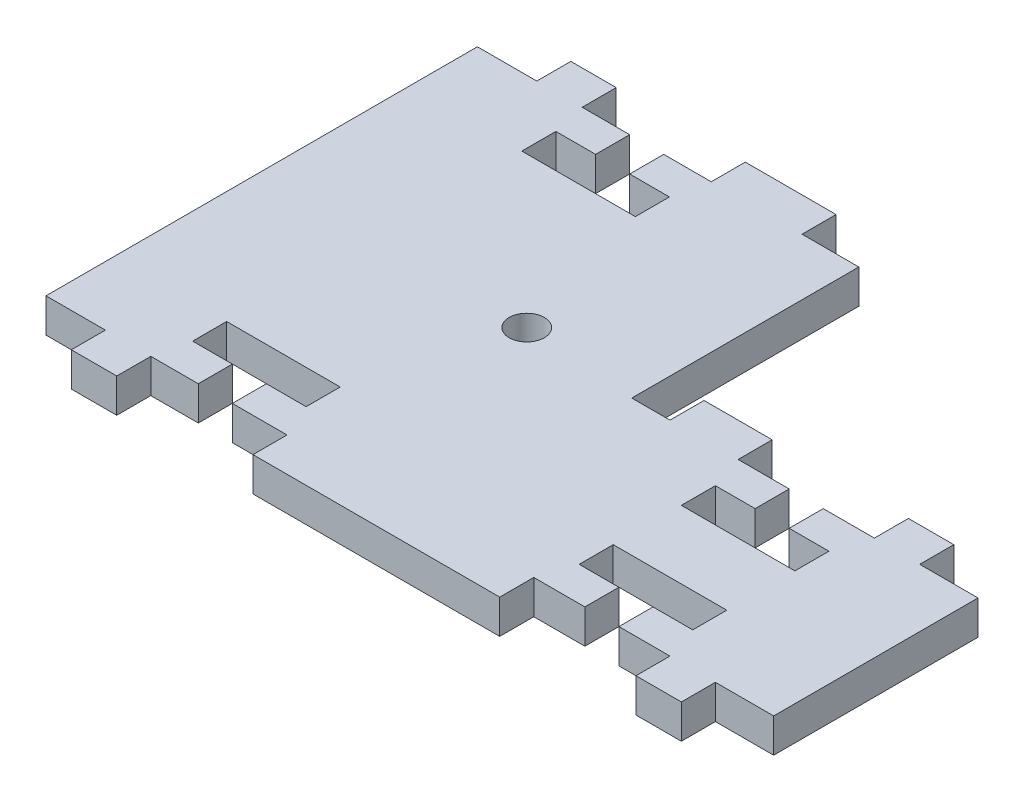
ISO-10303-21;
HEADER;
FILE_DESCRIPTION(('STEP AP214'),'2;1');
FILE_NAME('part.step','',(''),(''),'','','');
FILE_SCHEMA(('AUTOMOTIVE_DESIGN { 1 0 10303 214 1 1 1 1 }'));
ENDSEC;
DATA;
#1=APPLICATION_CONTEXT('core data for automotive mechanical design processes');
#2=APPLICATION_PROTOCOL_DEFINITION('international standard','automotive_design',2000,#1);
#3=PRODUCT_CONTEXT('',#1,'mechanical');
#4=PRODUCT('Part','Part','',(#3));
#5=PRODUCT_RELATED_PRODUCT_CATEGORY('part','',(#4));
#6=PRODUCT_DEFINITION_FORMATION('','',#4);
#7=PRODUCT_DEFINITION_CONTEXT('part definition',#1,'design');
#8=PRODUCT_DEFINITION('design','',#6,#7);
#9=PRODUCT_DEFINITION_SHAPE('','',#8);
#10=(LENGTH_UNIT() NAMED_UNIT(*) SI_UNIT(.MILLI.,.METRE.));
#11=(NAMED_UNIT(*) PLANE_ANGLE_UNIT() SI_UNIT($,.RADIAN.));
#12=(NAMED_UNIT(*) SI_UNIT($,.STERADIAN.) SOLID_ANGLE_UNIT());
#13=UNCERTAINTY_MEASURE_WITH_UNIT(LENGTH_MEASURE(1.E-05),#10,'distance_accuracy_value','');
#14=(GEOMETRIC_REPRESENTATION_CONTEXT(3) GLOBAL_UNCERTAINTY_ASSIGNED_CONTEXT((#13)) GLOBAL_UNIT_ASSIGNED_CONTEXT((#10,
#11,#12)) REPRESENTATION_CONTEXT('',''));
#15=CARTESIAN_POINT('',(0.,0.,0.));
#16=DIRECTION('',(0.,0.,1.));
#17=DIRECTION('',(1.,0.,0.));
#18=AXIS2_PLACEMENT_3D('',#15,#16,#17);
#19=CARTESIAN_POINT('',(0.,3.,0.));
#20=DIRECTION('',(0.,-1.,0.));
#21=DIRECTION('',(0.,0.,-1.));
#22=AXIS2_PLACEMENT_3D('',#19,#20,#21);
#23=PLANE('',#22);
#24=DIRECTION('',(0.,0.,-1.));
#25=VECTOR('',#24,1.);
#26=CARTESIAN_POINT('',(74.6837533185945,3.,-237.094105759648));
#27=LINE('',#26,#25);
#28=CARTESIAN_POINT('',(74.6837533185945,3.,-219.094105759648));
#29=VERTEX_POINT('',#28);
#30=CARTESIAN_POINT('',(74.6837533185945,3.,-237.094105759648));
#31=VERTEX_POINT('',#30);
#32=EDGE_CURVE('E606',#29,#31,#27,.T.);
#33=ORIENTED_EDGE('',*,*,#32,.T.);
#34=DIRECTION('',(-1.,0.,0.));
#35=VECTOR('',#34,1.);
#36=CARTESIAN_POINT('',(74.6837533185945,3.,-237.094105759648));
#37=LINE('',#36,#35);
#38=CARTESIAN_POINT('',(69.5518683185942,3.,-237.094105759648));
#39=VERTEX_POINT('',#38);
#40=EDGE_CURVE('E264',#31,#39,#37,.T.);
#41=ORIENTED_EDGE('',*,*,#40,.T.);
#42=DIRECTION('',(0.,0.,-1.));
#43=VECTOR('',#42,1.);
#44=CARTESIAN_POINT('',(69.5518683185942,3.,-237.094105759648));
#45=LINE('',#44,#43);
#46=CARTESIAN_POINT('',(69.5518683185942,3.,-240.094105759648));
#47=VERTEX_POINT('',#46);
#48=EDGE_CURVE('E795',#39,#47,#45,.T.);
#49=ORIENTED_EDGE('',*,*,#48,.T.);
#50=DIRECTION('',(-1.,0.,0.));
#51=VECTOR('',#50,1.);
#52=CARTESIAN_POINT('',(69.5518683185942,3.,-240.094105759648));
#53=LINE('',#52,#51);
#54=CARTESIAN_POINT('',(65.5518683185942,3.,-240.094105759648));
#55=VERTEX_POINT('',#54);
#56=EDGE_CURVE('E814',#47,#55,#53,.T.);
#57=ORIENTED_EDGE('',*,*,#56,.T.);
#58=DIRECTION('',(0.,0.,1.));
#59=VECTOR('',#58,1.);
#60=CARTESIAN_POINT('',(65.5518683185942,3.,-237.094105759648));
#61=LINE('',#60,#59);
#62=CARTESIAN_POINT('',(65.5518683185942,3.,-237.094105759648));
#63=VERTEX_POINT('',#62);
#64=EDGE_CURVE('E811',#55,#63,#61,.T.);
#65=ORIENTED_EDGE('',*,*,#64,.T.);
#66=DIRECTION('',(-1.,0.,0.));
#67=VECTOR('',#66,1.);
#68=CARTESIAN_POINT('',(65.5518683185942,3.,-237.094105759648));
#69=LINE('',#68,#67);
#70=CARTESIAN_POINT('',(61.0518683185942,3.,-237.094105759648));
#71=VERTEX_POINT('',#70);
#72=EDGE_CURVE('E813',#63,#71,#69,.T.);
#73=ORIENTED_EDGE('',*,*,#72,.T.);
#74=DIRECTION('',(0.,0.,1.));
#75=VECTOR('',#74,1.);
#76=CARTESIAN_POINT('',(61.0518683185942,3.,-234.094105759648));
#77=LINE('',#76,#75);
#78=CARTESIAN_POINT('',(61.0518683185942,3.,-234.094105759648));
#79=VERTEX_POINT('',#78);
#80=EDGE_CURVE('E816',#71,#79,#77,.T.);
#81=ORIENTED_EDGE('',*,*,#80,.T.);
#82=DIRECTION('',(1.,0.,0.));
#83=VECTOR('',#82,1.);
#84=CARTESIAN_POINT('',(64.5518683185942,3.,-234.094105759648));
#85=LINE('',#84,#83);
#86=CARTESIAN_POINT('',(64.5518683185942,3.,-234.094105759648));
#87=VERTEX_POINT('',#86);
#88=EDGE_CURVE('E822',#79,#87,#85,.T.);
#89=ORIENTED_EDGE('',*,*,#88,.T.);
#90=DIRECTION('',(0.,0.,1.));
#91=VECTOR('',#90,1.);
#92=CARTESIAN_POINT('',(64.5518683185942,3.,-231.094105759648));
#93=LINE('',#92,#91);
#94=CARTESIAN_POINT('',(64.5518683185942,3.,-231.094105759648));
#95=VERTEX_POINT('',#94);
#96=EDGE_CURVE('E824',#87,#95,#93,.T.);
#97=ORIENTED_EDGE('',*,*,#96,.T.);
#98=DIRECTION('',(-1.,0.,0.));
#99=VECTOR('',#98,1.);
#100=CARTESIAN_POINT('',(64.5518683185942,3.,-231.094105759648));
#101=LINE('',#100,#99);
#102=CARTESIAN_POINT('',(54.5518683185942,3.,-231.094105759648));
#103=VERTEX_POINT('',#102);
#104=EDGE_CURVE('E826',#95,#103,#101,.T.);
#105=ORIENTED_EDGE('',*,*,#104,.T.);
#106=DIRECTION('',(0.,0.,-1.));
#107=VECTOR('',#106,1.);
#108=CARTESIAN_POINT('',(54.5518683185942,3.,-231.094105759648));
#109=LINE('',#108,#107);
#110=CARTESIAN_POINT('',(54.5518683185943,3.,-234.094105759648));
#111=VERTEX_POINT('',#110);
#112=EDGE_CURVE('E828',#103,#111,#109,.T.);
#113=ORIENTED_EDGE('',*,*,#112,.T.);
#114=DIRECTION('',(1.,0.,0.));
#115=VECTOR('',#114,1.);
#116=CARTESIAN_POINT('',(58.0518683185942,3.,-234.094105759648));
#117=LINE('',#116,#115);
#118=CARTESIAN_POINT('',(58.0518683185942,3.,-234.094105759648));
#119=VERTEX_POINT('',#118);
#120=EDGE_CURVE('E830',#111,#119,#117,.T.);
#121=ORIENTED_EDGE('',*,*,#120,.T.);
#122=DIRECTION('',(0.,0.,-1.));
#123=VECTOR('',#122,1.);
#124=CARTESIAN_POINT('',(58.0518683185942,3.,-234.094105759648));
#125=LINE('',#124,#123);
#126=CARTESIAN_POINT('',(58.0518683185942,3.,-237.094105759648));
#127=VERTEX_POINT('',#126);
#128=EDGE_CURVE('E832',#119,#127,#125,.T.);
#129=ORIENTED_EDGE('',*,*,#128,.T.);
#130=DIRECTION('',(-1.,0.,0.));
#131=VECTOR('',#130,1.);
#132=CARTESIAN_POINT('',(58.0518683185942,3.,-237.094105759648));
#133=LINE('',#132,#131);
#134=CARTESIAN_POINT('',(53.5518683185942,3.,-237.094105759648));
#135=VERTEX_POINT('',#134);
#136=EDGE_CURVE('E834',#127,#135,#133,.T.);
#137=ORIENTED_EDGE('',*,*,#136,.T.);
#138=DIRECTION('',(0.,0.,-1.));
#139=VECTOR('',#138,1.);
#140=CARTESIAN_POINT('',(53.5518683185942,3.,-237.094105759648));
#141=LINE('',#140,#139);
#142=CARTESIAN_POINT('',(53.5518683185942,3.,-240.094105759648));
#143=VERTEX_POINT('',#142);
#144=EDGE_CURVE('E836',#135,#143,#141,.T.);
#145=ORIENTED_EDGE('',*,*,#144,.T.);
#146=DIRECTION('',(-1.,0.,0.));
#147=VECTOR('',#146,1.);
#148=CARTESIAN_POINT('',(53.5518683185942,3.,-240.094105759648));
#149=LINE('',#148,#147);
#150=CARTESIAN_POINT('',(47.5518683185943,3.,-240.094105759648));
#151=VERTEX_POINT('',#150);
#152=EDGE_CURVE('E838',#143,#151,#149,.T.);
#153=ORIENTED_EDGE('',*,*,#152,.T.);
#154=DIRECTION('',(0.,0.,1.));
#155=VECTOR('',#154,1.);
#156=CARTESIAN_POINT('',(47.5518683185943,3.,-237.094105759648));
#157=LINE('',#156,#155);
#158=CARTESIAN_POINT('',(47.5518683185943,3.,-237.094105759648));
#159=VERTEX_POINT('',#158);
#160=EDGE_CURVE('E840',#151,#159,#157,.T.);
#161=ORIENTED_EDGE('',*,*,#160,.T.);
#162=DIRECTION('',(-1.,0.,0.));
#163=VECTOR('',#162,1.);
#164=CARTESIAN_POINT('',(47.5518683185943,3.,-237.094105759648));
#165=LINE('',#164,#163);
#166=CARTESIAN_POINT('',(44.1837528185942,3.,-237.094105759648));
#167=VERTEX_POINT('',#166);
#168=EDGE_CURVE('E842',#159,#167,#165,.T.);
#169=ORIENTED_EDGE('',*,*,#168,.T.);
#170=DIRECTION('',(0.,0.,-1.));
#171=VECTOR('',#170,1.);
#172=CARTESIAN_POINT('',(44.1837528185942,3.,-237.094105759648));
#173=LINE('',#172,#171);
#174=CARTESIAN_POINT('',(44.1837528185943,3.,-257.094105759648));
#175=VERTEX_POINT('',#174);
#176=EDGE_CURVE('E844',#167,#175,#173,.T.);
#177=ORIENTED_EDGE('',*,*,#176,.T.);
#178=DIRECTION('',(-1.,0.,0.));
#179=VECTOR('',#178,1.);
#180=CARTESIAN_POINT('',(44.1837528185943,3.,-257.094105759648));
#181=LINE('',#180,#179);
#182=CARTESIAN_POINT('',(39.1837528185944,3.,-257.094105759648));
#183=VERTEX_POINT('',#182);
#184=EDGE_CURVE('E846',#175,#183,#181,.T.);
#185=ORIENTED_EDGE('',*,*,#184,.T.);
#186=DIRECTION('',(0.,0.,-1.));
#187=VECTOR('',#186,1.);
#188=CARTESIAN_POINT('',(39.1837528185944,3.,-257.094105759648));
#189=LINE('',#188,#187);
#190=CARTESIAN_POINT('',(39.1837528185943,3.,-260.094105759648));
#191=VERTEX_POINT('',#190);
#192=EDGE_CURVE('E848',#183,#191,#189,.T.);
#193=ORIENTED_EDGE('',*,*,#192,.T.);
#194=DIRECTION('',(-1.,0.,0.));
#195=VECTOR('',#194,1.);
#196=CARTESIAN_POINT('',(39.1837528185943,3.,-260.094105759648));
#197=LINE('',#196,#195);
#198=CARTESIAN_POINT('',(31.1837528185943,3.,-260.094105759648));
#199=VERTEX_POINT('',#198);
#200=EDGE_CURVE('E850',#191,#199,#197,.T.);
#201=ORIENTED_EDGE('',*,*,#200,.T.);
#202=DIRECTION('',(0.,0.,1.));
#203=VECTOR('',#202,1.);
#204=CARTESIAN_POINT('',(31.1837528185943,3.,-257.094105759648));
#205=LINE('',#204,#203);
#206=CARTESIAN_POINT('',(31.1837528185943,3.,-257.094105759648));
#207=VERTEX_POINT('',#206);
#208=EDGE_CURVE('E852',#199,#207,#205,.T.);
#209=ORIENTED_EDGE('',*,*,#208,.T.);
#210=DIRECTION('',(-1.,0.,0.));
#211=VECTOR('',#210,1.);
#212=CARTESIAN_POINT('',(31.1837528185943,3.,-257.094105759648));
#213=LINE('',#212,#211);
#214=CARTESIAN_POINT('',(26.9996950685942,3.,-257.094105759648));
#215=VERTEX_POINT('',#214);
#216=EDGE_CURVE('E854',#207,#215,#213,.T.);
#217=ORIENTED_EDGE('',*,*,#216,.T.);
#218=DIRECTION('',(0.,0.,1.));
#219=VECTOR('',#218,1.);
#220=CARTESIAN_POINT('',(26.9996950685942,3.,-254.094105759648));
#221=LINE('',#220,#219);
#222=CARTESIAN_POINT('',(26.9996950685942,3.,-254.094105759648));
#223=VERTEX_POINT('',#222);
#224=EDGE_CURVE('E856',#215,#223,#221,.T.);
#225=ORIENTED_EDGE('',*,*,#224,.T.);
#226=DIRECTION('',(1.,0.,0.));
#227=VECTOR('',#226,1.);
#228=CARTESIAN_POINT('',(30.4996950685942,3.,-254.094105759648));
#229=LINE('',#228,#227);
#230=CARTESIAN_POINT('',(30.4996950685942,3.,-254.094105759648));
#231=VERTEX_POINT('',#230);
#232=EDGE_CURVE('E858',#223,#231,#229,.T.);
#233=ORIENTED_EDGE('',*,*,#232,.T.);
#234=DIRECTION('',(0.,0.,1.));
#235=VECTOR('',#234,1.);
#236=CARTESIAN_POINT('',(30.4996950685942,3.,-251.094105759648));
#237=LINE('',#236,#235);
#238=CARTESIAN_POINT('',(30.4996950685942,3.,-251.094105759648));
#239=VERTEX_POINT('',#238);
#240=EDGE_CURVE('E860',#231,#239,#237,.T.);
#241=ORIENTED_EDGE('',*,*,#240,.T.);
#242=DIRECTION('',(-1.,0.,0.));
#243=VECTOR('',#242,1.);
#244=CARTESIAN_POINT('',(30.4996950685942,3.,-251.094105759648));
#245=LINE('',#244,#243);
#246=CARTESIAN_POINT('',(20.4996950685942,3.,-251.094105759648));
#247=VERTEX_POINT('',#246);
#248=EDGE_CURVE('E862',#239,#247,#245,.T.);
#249=ORIENTED_EDGE('',*,*,#248,.T.);
#250=DIRECTION('',(0.,0.,-1.));
#251=VECTOR('',#250,1.);
#252=CARTESIAN_POINT('',(20.4996950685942,3.,-251.094105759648));
#253=LINE('',#252,#251);
#254=CARTESIAN_POINT('',(20.4996950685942,3.,-254.094105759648));
#255=VERTEX_POINT('',#254);
#256=EDGE_CURVE('E864',#247,#255,#253,.T.);
#257=ORIENTED_EDGE('',*,*,#256,.T.);
#258=DIRECTION('',(1.,0.,0.));
#259=VECTOR('',#258,1.);
#260=CARTESIAN_POINT('',(23.9996950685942,3.,-254.094105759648));
#261=LINE('',#260,#259);
#262=CARTESIAN_POINT('',(23.9996950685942,3.,-254.094105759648));
#263=VERTEX_POINT('',#262);
#264=EDGE_CURVE('E866',#255,#263,#261,.T.);
#265=ORIENTED_EDGE('',*,*,#264,.T.);
#266=DIRECTION('',(0.,0.,-1.));
#267=VECTOR('',#266,1.);
#268=CARTESIAN_POINT('',(23.9996950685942,3.,-254.094105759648));
#269=LINE('',#268,#267);
#270=CARTESIAN_POINT('',(23.9996950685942,3.,-257.094105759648));
#271=VERTEX_POINT('',#270);
#272=EDGE_CURVE('E868',#263,#271,#269,.T.);
#273=ORIENTED_EDGE('',*,*,#272,.T.);
#274=DIRECTION('',(-1.,0.,0.));
#275=VECTOR('',#274,1.);
#276=CARTESIAN_POINT('',(23.9996950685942,3.,-257.094105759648));
#277=LINE('',#276,#275);
#278=CARTESIAN_POINT('',(19.8156373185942,3.,-257.094105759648));
#279=VERTEX_POINT('',#278);
#280=EDGE_CURVE('E870',#271,#279,#277,.T.);
#281=ORIENTED_EDGE('',*,*,#280,.T.);
#282=DIRECTION('',(0.,0.,-1.));
#283=VECTOR('',#282,1.);
#284=CARTESIAN_POINT('',(19.8156373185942,3.,-260.094105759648));
#285=LINE('',#284,#283);
#286=CARTESIAN_POINT('',(19.8156373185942,3.,-260.094105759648));
#287=VERTEX_POINT('',#286);
#288=EDGE_CURVE('E872',#279,#287,#285,.T.);
#289=ORIENTED_EDGE('',*,*,#288,.T.);
#290=DIRECTION('',(-1.,0.,0.));
#291=VECTOR('',#290,1.);
#292=CARTESIAN_POINT('',(19.8156373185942,3.,-260.094105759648));
#293=LINE('',#292,#291);
#294=CARTESIAN_POINT('',(15.8156373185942,3.,-260.094105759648));
#295=VERTEX_POINT('',#294);
#296=EDGE_CURVE('E874',#287,#295,#293,.T.);
#297=ORIENTED_EDGE('',*,*,#296,.T.);
#298=DIRECTION('',(0.,0.,1.));
#299=VECTOR('',#298,1.);
#300=CARTESIAN_POINT('',(15.8156373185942,3.,-260.094105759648));
#301=LINE('',#300,#299);
#302=CARTESIAN_POINT('',(15.8156373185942,3.,-257.094105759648));
#303=VERTEX_POINT('',#302);
#304=EDGE_CURVE('E876',#295,#303,#301,.T.);
#305=ORIENTED_EDGE('',*,*,#304,.T.);
#306=DIRECTION('',(-1.,0.,0.));
#307=VECTOR('',#306,1.);
#308=CARTESIAN_POINT('',(15.8156373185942,3.,-257.094105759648));
#309=LINE('',#308,#307);
#310=CARTESIAN_POINT('',(10.5837533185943,3.,-257.094105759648));
#311=VERTEX_POINT('',#310);
#312=EDGE_CURVE('E878',#303,#311,#309,.T.);
#313=ORIENTED_EDGE('',*,*,#312,.T.);
#314=DIRECTION('',(0.,0.,1.));
#315=VECTOR('',#314,1.);
#316=CARTESIAN_POINT('',(10.5837533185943,3.,-257.094105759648));
#317=LINE('',#316,#315);
#318=CARTESIAN_POINT('',(10.5837533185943,3.,-219.094105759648));
#319=VERTEX_POINT('',#318);
#320=EDGE_CURVE('E880',#311,#319,#317,.T.);
#321=ORIENTED_EDGE('',*,*,#320,.T.);
#322=DIRECTION('',(1.,0.,0.));
#323=VECTOR('',#322,1.);
#324=CARTESIAN_POINT('',(15.8156373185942,3.,-219.094105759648));
#325=LINE('',#324,#323);
#326=CARTESIAN_POINT('',(15.8156373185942,3.,-219.094105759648));
#327=VERTEX_POINT('',#326);
#328=EDGE_CURVE('E882',#319,#327,#325,.T.);
#329=ORIENTED_EDGE('',*,*,#328,.T.);
#330=DIRECTION('',(0.,0.,1.));
#331=VECTOR('',#330,1.);
#332=CARTESIAN_POINT('',(15.8156373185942,3.,-219.094105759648));
#333=LINE('',#332,#331);
#334=CARTESIAN_POINT('',(15.8156373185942,3.,-216.094105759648));
#335=VERTEX_POINT('',#334);
#336=EDGE_CURVE('E884',#327,#335,#333,.T.);
#337=ORIENTED_EDGE('',*,*,#336,.T.);
#338=DIRECTION('',(1.,0.,0.));
#339=VECTOR('',#338,1.);
#340=CARTESIAN_POINT('',(19.8156373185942,3.,-216.094105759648));
#341=LINE('',#340,#339);
#342=CARTESIAN_POINT('',(19.8156373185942,3.,-216.094105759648));
#343=VERTEX_POINT('',#342);
#344=EDGE_CURVE('E886',#335,#343,#341,.T.);
#345=ORIENTED_EDGE('',*,*,#344,.T.);
#346=DIRECTION('',(0.,0.,-1.));
#347=VECTOR('',#346,1.);
#348=CARTESIAN_POINT('',(19.8156373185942,3.,-219.094105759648));
#349=LINE('',#348,#347);
#350=CARTESIAN_POINT('',(19.8156373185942,3.,-219.094105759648));
#351=VERTEX_POINT('',#350);
#352=EDGE_CURVE('E888',#343,#351,#349,.T.);
#353=ORIENTED_EDGE('',*,*,#352,.T.);
#354=DIRECTION('',(1.,0.,0.));
#355=VECTOR('',#354,1.);
#356=CARTESIAN_POINT('',(23.9996950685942,3.,-219.094105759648));
#357=LINE('',#356,#355);
#358=CARTESIAN_POINT('',(23.9996950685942,3.,-219.094105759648));
#359=VERTEX_POINT('',#358);
#360=EDGE_CURVE('E890',#351,#359,#357,.T.);
#361=ORIENTED_EDGE('',*,*,#360,.T.);
#362=DIRECTION('',(0.,0.,-1.));
#363=VECTOR('',#362,1.);
#364=CARTESIAN_POINT('',(23.9996950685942,3.,-222.094105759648));
#365=LINE('',#364,#363);
#366=CARTESIAN_POINT('',(23.9996950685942,3.,-222.094105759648));
#367=VERTEX_POINT('',#366);
#368=EDGE_CURVE('E892',#359,#367,#365,.T.);
#369=ORIENTED_EDGE('',*,*,#368,.T.);
#370=DIRECTION('',(-1.,0.,0.));
#371=VECTOR('',#370,1.);
#372=CARTESIAN_POINT('',(23.9996950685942,3.,-222.094105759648));
#373=LINE('',#372,#371);
#374=CARTESIAN_POINT('',(20.4996950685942,3.,-222.094105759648));
#375=VERTEX_POINT('',#374);
#376=EDGE_CURVE('E894',#367,#375,#373,.T.);
#377=ORIENTED_EDGE('',*,*,#376,.T.);
#378=DIRECTION('',(0.,0.,-1.));
#379=VECTOR('',#378,1.);
#380=CARTESIAN_POINT('',(20.4996950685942,3.,-225.094105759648));
#381=LINE('',#380,#379);
#382=CARTESIAN_POINT('',(20.4996950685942,3.,-225.094105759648));
#383=VERTEX_POINT('',#382);
#384=EDGE_CURVE('E896',#375,#383,#381,.T.);
#385=ORIENTED_EDGE('',*,*,#384,.T.);
#386=DIRECTION('',(1.,0.,0.));
#387=VECTOR('',#386,1.);
#388=CARTESIAN_POINT('',(30.4996950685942,3.,-225.094105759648));
#389=LINE('',#388,#387);
#390=CARTESIAN_POINT('',(30.4996950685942,3.,-225.094105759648));
#391=VERTEX_POINT('',#390);
#392=EDGE_CURVE('E898',#383,#391,#389,.T.);
#393=ORIENTED_EDGE('',*,*,#392,.T.);
#394=DIRECTION('',(0.,0.,1.));
#395=VECTOR('',#394,1.);
#396=CARTESIAN_POINT('',(30.4996950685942,3.,-225.094105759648));
#397=LINE('',#396,#395);
#398=CARTESIAN_POINT('',(30.4996950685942,3.,-222.094105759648));
#399=VERTEX_POINT('',#398);
#400=EDGE_CURVE('E900',#391,#399,#397,.T.);
#401=ORIENTED_EDGE('',*,*,#400,.T.);
#402=DIRECTION('',(-1.,0.,0.));
#403=VECTOR('',#402,1.);
#404=CARTESIAN_POINT('',(30.4996950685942,3.,-222.094105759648));
#405=LINE('',#404,#403);
#406=CARTESIAN_POINT('',(26.9996950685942,3.,-222.094105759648));
#407=VERTEX_POINT('',#406);
#408=EDGE_CURVE('E902',#399,#407,#405,.T.);
#409=ORIENTED_EDGE('',*,*,#408,.T.);
#410=DIRECTION('',(0.,0.,1.));
#411=VECTOR('',#410,1.);
#412=CARTESIAN_POINT('',(26.9996950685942,3.,-222.094105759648));
#413=LINE('',#412,#411);
#414=CARTESIAN_POINT('',(26.9996950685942,3.,-219.094105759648));
#415=VERTEX_POINT('',#414);
#416=EDGE_CURVE('E904',#407,#415,#413,.T.);
#417=ORIENTED_EDGE('',*,*,#416,.T.);
#418=DIRECTION('',(1.,0.,0.));
#419=VECTOR('',#418,1.);
#420=CARTESIAN_POINT('',(31.8156373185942,3.,-219.094105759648));
#421=LINE('',#420,#419);
#422=CARTESIAN_POINT('',(31.8156373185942,3.,-219.094105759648));
#423=VERTEX_POINT('',#422);
#424=EDGE_CURVE('E906',#415,#423,#421,.T.);
#425=ORIENTED_EDGE('',*,*,#424,.T.);
#426=DIRECTION('',(0.,0.,1.));
#427=VECTOR('',#426,1.);
#428=CARTESIAN_POINT('',(31.8156373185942,3.,-219.094105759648));
#429=LINE('',#428,#427);
#430=CARTESIAN_POINT('',(31.8156373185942,3.,-216.094105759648));
#431=VERTEX_POINT('',#430);
#432=EDGE_CURVE('E908',#423,#431,#429,.T.);
#433=ORIENTED_EDGE('',*,*,#432,.T.);
#434=DIRECTION('',(1.,0.,0.));
#435=VECTOR('',#434,1.);
#436=CARTESIAN_POINT('',(53.5518683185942,3.,-216.094105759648));
#437=LINE('',#436,#435);
#438=CARTESIAN_POINT('',(53.5518683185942,3.,-216.094105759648));
#439=VERTEX_POINT('',#438);
#440=EDGE_CURVE('E910',#431,#439,#437,.T.);
#441=ORIENTED_EDGE('',*,*,#440,.T.);
#442=DIRECTION('',(0.,0.,-1.));
#443=VECTOR('',#442,1.);
#444=CARTESIAN_POINT('',(53.5518683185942,3.,-216.094105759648));
#445=LINE('',#444,#443);
#446=CARTESIAN_POINT('',(53.5518683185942,3.,-219.094105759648));
#447=VERTEX_POINT('',#446);
#448=EDGE_CURVE('E912',#439,#447,#445,.T.);
#449=ORIENTED_EDGE('',*,*,#448,.T.);
#450=DIRECTION('',(1.,0.,0.));
#451=VECTOR('',#450,1.);
#452=CARTESIAN_POINT('',(58.0518683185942,3.,-219.094105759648));
#453=LINE('',#452,#451);
#454=CARTESIAN_POINT('',(58.0518683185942,3.,-219.094105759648));
#455=VERTEX_POINT('',#454);
#456=EDGE_CURVE('E914',#447,#455,#453,.T.);
#457=ORIENTED_EDGE('',*,*,#456,.T.);
#458=DIRECTION('',(0.,0.,-1.));
#459=VECTOR('',#458,1.);
#460=CARTESIAN_POINT('',(58.0518683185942,3.,-222.094105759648));
#461=LINE('',#460,#459);
#462=CARTESIAN_POINT('',(58.0518683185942,3.,-222.094105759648));
#463=VERTEX_POINT('',#462);
#464=EDGE_CURVE('E916',#455,#463,#461,.T.);
#465=ORIENTED_EDGE('',*,*,#464,.T.);
#466=DIRECTION('',(-1.,0.,0.));
#467=VECTOR('',#466,1.);
#468=CARTESIAN_POINT('',(58.0518683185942,3.,-222.094105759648));
#469=LINE('',#468,#467);
#470=CARTESIAN_POINT('',(54.5518683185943,3.,-222.094105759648));
#471=VERTEX_POINT('',#470);
#472=EDGE_CURVE('E918',#463,#471,#469,.T.);
#473=ORIENTED_EDGE('',*,*,#472,.T.);
#474=DIRECTION('',(0.,0.,-1.));
#475=VECTOR('',#474,1.);
#476=CARTESIAN_POINT('',(54.5518683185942,3.,-225.094105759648));
#477=LINE('',#476,#475);
#478=CARTESIAN_POINT('',(54.5518683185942,3.,-225.094105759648));
#479=VERTEX_POINT('',#478);
#480=EDGE_CURVE('E920',#471,#479,#477,.T.);
#481=ORIENTED_EDGE('',*,*,#480,.T.);
#482=DIRECTION('',(1.,0.,0.));
#483=VECTOR('',#482,1.);
#484=CARTESIAN_POINT('',(64.5518683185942,3.,-225.094105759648));
#485=LINE('',#484,#483);
#486=CARTESIAN_POINT('',(64.5518683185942,3.,-225.094105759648));
#487=VERTEX_POINT('',#486);
#488=EDGE_CURVE('E922',#479,#487,#485,.T.);
#489=ORIENTED_EDGE('',*,*,#488,.T.);
#490=DIRECTION('',(0.,0.,1.));
#491=VECTOR('',#490,1.);
#492=CARTESIAN_POINT('',(64.5518683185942,3.,-225.094105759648));
#493=LINE('',#492,#491);
#494=CARTESIAN_POINT('',(64.5518683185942,3.,-222.094105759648));
#495=VERTEX_POINT('',#494);
#496=EDGE_CURVE('E924',#487,#495,#493,.T.);
#497=ORIENTED_EDGE('',*,*,#496,.T.);
#498=DIRECTION('',(-1.,0.,0.));
#499=VECTOR('',#498,1.);
#500=CARTESIAN_POINT('',(64.5518683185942,3.,-222.094105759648));
#501=LINE('',#500,#499);
#502=CARTESIAN_POINT('',(61.0518683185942,3.,-222.094105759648));
#503=VERTEX_POINT('',#502);
#504=EDGE_CURVE('E926',#495,#503,#501,.T.);
#505=ORIENTED_EDGE('',*,*,#504,.T.);
#506=DIRECTION('',(0.,0.,1.));
#507=VECTOR('',#506,1.);
#508=CARTESIAN_POINT('',(61.0518683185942,3.,-222.094105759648));
#509=LINE('',#508,#507);
#510=CARTESIAN_POINT('',(61.0518683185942,3.,-219.094105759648));
#511=VERTEX_POINT('',#510);
#512=EDGE_CURVE('E928',#503,#511,#509,.T.);
#513=ORIENTED_EDGE('',*,*,#512,.T.);
#514=DIRECTION('',(1.,0.,0.));
#515=VECTOR('',#514,1.);
#516=CARTESIAN_POINT('',(65.5518683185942,3.,-219.094105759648));
#517=LINE('',#516,#515);
#518=CARTESIAN_POINT('',(65.5518683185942,3.,-219.094105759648));
#519=VERTEX_POINT('',#518);
#520=EDGE_CURVE('E930',#511,#519,#517,.T.);
#521=ORIENTED_EDGE('',*,*,#520,.T.);
#522=DIRECTION('',(0.,0.,1.));
#523=VECTOR('',#522,1.);
#524=CARTESIAN_POINT('',(65.5518683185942,3.,-219.094105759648));
#525=LINE('',#524,#523);
#526=CARTESIAN_POINT('',(65.5518683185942,3.,-216.094105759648));
#527=VERTEX_POINT('',#526);
#528=EDGE_CURVE('E457',#519,#527,#525,.T.);
#529=ORIENTED_EDGE('',*,*,#528,.T.);
#530=DIRECTION('',(1.,0.,0.));
#531=VECTOR('',#530,1.);
#532=CARTESIAN_POINT('',(69.5518683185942,3.,-216.094105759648));
#533=LINE('',#532,#531);
#534=CARTESIAN_POINT('',(69.5518683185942,3.,-216.094105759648));
#535=VERTEX_POINT('',#534);
#536=EDGE_CURVE('E451',#527,#535,#533,.T.);
#537=ORIENTED_EDGE('',*,*,#536,.T.);
#538=DIRECTION('',(0.,0.,-1.));
#539=VECTOR('',#538,1.);
#540=CARTESIAN_POINT('',(69.5518683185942,3.,-219.094105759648));
#541=LINE('',#540,#539);
#542=CARTESIAN_POINT('',(69.5518683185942,3.,-219.094105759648));
#543=VERTEX_POINT('',#542);
#544=EDGE_CURVE('E455',#535,#543,#541,.T.);
#545=ORIENTED_EDGE('',*,*,#544,.T.);
#546=DIRECTION('',(1.,0.,0.));
#547=VECTOR('',#546,1.);
#548=CARTESIAN_POINT('',(74.6837533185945,3.,-219.094105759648));
#549=LINE('',#548,#547);
#550=EDGE_CURVE('E47',#543,#29,#549,.T.);
#551=ORIENTED_EDGE('',*,*,#550,.T.);
#552=EDGE_LOOP('',(#33,#41,#49,#57,#65,#73,#81,#89,#97,#105,#113,#121,#129,#137,#145,#153,#161,
#169,#177,#185,#193,#201,#209,#217,#225,#233,#241,#249,#257,#265,#273,#281,#289,#297,#305,#313,
#321,#329,#337,#345,#353,#361,#369,#377,#385,#393,#401,#409,#417,#425,#433,#441,#449,#457,#465,
#473,#481,#489,#497,#505,#513,#521,#529,#537,#545,#551));
#553=FACE_BOUND('',#552,.T.);
#554=CARTESIAN_POINT('',(34.1837528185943,3.,-237.844105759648));
#555=DIRECTION('',(0.,1.,0.));
#556=DIRECTION('',(0.,0.,1.));
#557=AXIS2_PLACEMENT_3D('',#554,#555,#556);
#558=CIRCLE('',#557,1.55);
#559=CARTESIAN_POINT('',(34.1837528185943,3.,-236.294105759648));
#560=VERTEX_POINT('',#559);
#561=EDGE_CURVE('E479',#560,#560,#558,.T.);
#562=ORIENTED_EDGE('',*,*,#561,.F.);
#563=EDGE_LOOP('',(#562));
#564=FACE_BOUND('',#563,.T.);
#565=ADVANCED_FACE('F30',(#553,#564),#23,.F.);
#566=CARTESIAN_POINT('',(0.,0.,0.));
#567=DIRECTION('',(0.,-1.,0.));
#568=DIRECTION('',(0.,0.,-1.));
#569=AXIS2_PLACEMENT_3D('',#566,#567,#568);
#570=PLANE('',#569);
#571=DIRECTION('',(0.,0.,-1.));
#572=VECTOR('',#571,1.);
#573=CARTESIAN_POINT('',(74.6837533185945,0.,-237.094105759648));
#574=LINE('',#573,#572);
#575=CARTESIAN_POINT('',(74.6837533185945,0.,-219.094105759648));
#576=VERTEX_POINT('',#575);
#577=CARTESIAN_POINT('',(74.6837533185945,0.,-237.094105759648));
#578=VERTEX_POINT('',#577);
#579=EDGE_CURVE('E475',#576,#578,#574,.T.);
#580=ORIENTED_EDGE('',*,*,#579,.F.);
#581=DIRECTION('',(1.,0.,0.));
#582=VECTOR('',#581,1.);
#583=CARTESIAN_POINT('',(74.6837533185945,0.,-219.094105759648));
#584=LINE('',#583,#582);
#585=CARTESIAN_POINT('',(69.5518683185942,0.,-219.094105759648));
#586=VERTEX_POINT('',#585);
#587=EDGE_CURVE('E256',#586,#576,#584,.T.);
#588=ORIENTED_EDGE('',*,*,#587,.F.);
#589=DIRECTION('',(0.,0.,-1.));
#590=VECTOR('',#589,1.);
#591=CARTESIAN_POINT('',(69.5518683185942,0.,-219.094105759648));
#592=LINE('',#591,#590);
#593=CARTESIAN_POINT('',(69.5518683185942,0.,-216.094105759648));
#594=VERTEX_POINT('',#593);
#595=EDGE_CURVE('E250',#594,#586,#592,.T.);
#596=ORIENTED_EDGE('',*,*,#595,.F.);
#597=DIRECTION('',(1.,0.,0.));
#598=VECTOR('',#597,1.);
#599=CARTESIAN_POINT('',(69.5518683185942,0.,-216.094105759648));
#600=LINE('',#599,#598);
#601=CARTESIAN_POINT('',(65.5518683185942,0.,-216.094105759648));
#602=VERTEX_POINT('',#601);
#603=EDGE_CURVE('E465',#602,#594,#600,.T.);
#604=ORIENTED_EDGE('',*,*,#603,.F.);
#605=DIRECTION('',(0.,0.,1.));
#606=VECTOR('',#605,1.);
#607=CARTESIAN_POINT('',(65.5518683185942,0.,-219.094105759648));
#608=LINE('',#607,#606);
#609=CARTESIAN_POINT('',(65.5518683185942,0.,-219.094105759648));
#610=VERTEX_POINT('',#609);
#611=EDGE_CURVE('E601',#610,#602,#608,.T.);
#612=ORIENTED_EDGE('',*,*,#611,.F.);
#613=DIRECTION('',(1.,0.,0.));
#614=VECTOR('',#613,1.);
#615=CARTESIAN_POINT('',(65.5518683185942,0.,-219.094105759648));
#616=LINE('',#615,#614);
#617=CARTESIAN_POINT('',(61.0518683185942,0.,-219.094105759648));
#618=VERTEX_POINT('',#617);
#619=EDGE_CURVE('E599',#618,#610,#616,.T.);
#620=ORIENTED_EDGE('',*,*,#619,.F.);
#621=DIRECTION('',(0.,0.,1.));
#622=VECTOR('',#621,1.);
#623=CARTESIAN_POINT('',(61.0518683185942,0.,-222.094105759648));
#624=LINE('',#623,#622);
#625=CARTESIAN_POINT('',(61.0518683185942,0.,-222.094105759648));
#626=VERTEX_POINT('',#625);
#627=EDGE_CURVE('E597',#626,#618,#624,.T.);
#628=ORIENTED_EDGE('',*,*,#627,.F.);
#629=DIRECTION('',(-1.,0.,0.));
#630=VECTOR('',#629,1.);
#631=CARTESIAN_POINT('',(64.5518683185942,0.,-222.094105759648));
#632=LINE('',#631,#630);
#633=CARTESIAN_POINT('',(64.5518683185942,0.,-222.094105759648));
#634=VERTEX_POINT('',#633);
#635=EDGE_CURVE('E595',#634,#626,#632,.T.);
#636=ORIENTED_EDGE('',*,*,#635,.F.);
#637=DIRECTION('',(0.,0.,1.));
#638=VECTOR('',#637,1.);
#639=CARTESIAN_POINT('',(64.5518683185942,0.,-225.094105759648));
#640=LINE('',#639,#638);
#641=CARTESIAN_POINT('',(64.5518683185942,0.,-225.094105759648));
#642=VERTEX_POINT('',#641);
#643=EDGE_CURVE('E593',#642,#634,#640,.T.);
#644=ORIENTED_EDGE('',*,*,#643,.F.);
#645=DIRECTION('',(1.,0.,0.));
#646=VECTOR('',#645,1.);
#647=CARTESIAN_POINT('',(64.5518683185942,0.,-225.094105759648));
#648=LINE('',#647,#646);
#649=CARTESIAN_POINT('',(54.5518683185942,0.,-225.094105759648));
#650=VERTEX_POINT('',#649);
#651=EDGE_CURVE('E591',#650,#642,#648,.T.);
#652=ORIENTED_EDGE('',*,*,#651,.F.);
#653=DIRECTION('',(0.,0.,-1.));
#654=VECTOR('',#653,1.);
#655=CARTESIAN_POINT('',(54.5518683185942,0.,-225.094105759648));
#656=LINE('',#655,#654);
#657=CARTESIAN_POINT('',(54.5518683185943,0.,-222.094105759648));
#658=VERTEX_POINT('',#657);
#659=EDGE_CURVE('E589',#658,#650,#656,.T.);
#660=ORIENTED_EDGE('',*,*,#659,.F.);
#661=DIRECTION('',(-1.,0.,0.));
#662=VECTOR('',#661,1.);
#663=CARTESIAN_POINT('',(58.0518683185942,0.,-222.094105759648));
#664=LINE('',#663,#662);
#665=CARTESIAN_POINT('',(58.0518683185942,0.,-222.094105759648));
#666=VERTEX_POINT('',#665);
#667=EDGE_CURVE('E587',#666,#658,#664,.T.);
#668=ORIENTED_EDGE('',*,*,#667,.F.);
#669=DIRECTION('',(0.,0.,-1.));
#670=VECTOR('',#669,1.);
#671=CARTESIAN_POINT('',(58.0518683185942,0.,-222.094105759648));
#672=LINE('',#671,#670);
#673=CARTESIAN_POINT('',(58.0518683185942,0.,-219.094105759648));
#674=VERTEX_POINT('',#673);
#675=EDGE_CURVE('E585',#674,#666,#672,.T.);
#676=ORIENTED_EDGE('',*,*,#675,.F.);
#677=DIRECTION('',(1.,0.,0.));
#678=VECTOR('',#677,1.);
#679=CARTESIAN_POINT('',(58.0518683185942,0.,-219.094105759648));
#680=LINE('',#679,#678);
#681=CARTESIAN_POINT('',(53.5518683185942,0.,-219.094105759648));
#682=VERTEX_POINT('',#681);
#683=EDGE_CURVE('E583',#682,#674,#680,.T.);
#684=ORIENTED_EDGE('',*,*,#683,.F.);
#685=DIRECTION('',(0.,0.,-1.));
#686=VECTOR('',#685,1.);
#687=CARTESIAN_POINT('',(53.5518683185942,0.,-216.094105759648));
#688=LINE('',#687,#686);
#689=CARTESIAN_POINT('',(53.5518683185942,0.,-216.094105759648));
#690=VERTEX_POINT('',#689);
#691=EDGE_CURVE('E581',#690,#682,#688,.T.);
#692=ORIENTED_EDGE('',*,*,#691,.F.);
#693=DIRECTION('',(1.,0.,0.));
#694=VECTOR('',#693,1.);
#695=CARTESIAN_POINT('',(53.5518683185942,0.,-216.094105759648));
#696=LINE('',#695,#694);
#697=CARTESIAN_POINT('',(31.8156373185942,0.,-216.094105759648));
#698=VERTEX_POINT('',#697);
#699=EDGE_CURVE('E579',#698,#690,#696,.T.);
#700=ORIENTED_EDGE('',*,*,#699,.F.);
#701=DIRECTION('',(0.,0.,1.));
#702=VECTOR('',#701,1.);
#703=CARTESIAN_POINT('',(31.8156373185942,0.,-219.094105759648));
#704=LINE('',#703,#702);
#705=CARTESIAN_POINT('',(31.8156373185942,0.,-219.094105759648));
#706=VERTEX_POINT('',#705);
#707=EDGE_CURVE('E577',#706,#698,#704,.T.);
#708=ORIENTED_EDGE('',*,*,#707,.F.);
#709=DIRECTION('',(1.,0.,0.));
#710=VECTOR('',#709,1.);
#711=CARTESIAN_POINT('',(31.8156373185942,0.,-219.094105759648));
#712=LINE('',#711,#710);
#713=CARTESIAN_POINT('',(26.9996950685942,0.,-219.094105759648));
#714=VERTEX_POINT('',#713);
#715=EDGE_CURVE('E575',#714,#706,#712,.T.);
#716=ORIENTED_EDGE('',*,*,#715,.F.);
#717=DIRECTION('',(0.,0.,1.));
#718=VECTOR('',#717,1.);
#719=CARTESIAN_POINT('',(26.9996950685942,0.,-222.094105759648));
#720=LINE('',#719,#718);
#721=CARTESIAN_POINT('',(26.9996950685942,0.,-222.094105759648));
#722=VERTEX_POINT('',#721);
#723=EDGE_CURVE('E573',#722,#714,#720,.T.);
#724=ORIENTED_EDGE('',*,*,#723,.F.);
#725=DIRECTION('',(-1.,0.,0.));
#726=VECTOR('',#725,1.);
#727=CARTESIAN_POINT('',(30.4996950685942,0.,-222.094105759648));
#728=LINE('',#727,#726);
#729=CARTESIAN_POINT('',(30.4996950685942,0.,-222.094105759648));
#730=VERTEX_POINT('',#729);
#731=EDGE_CURVE('E571',#730,#722,#728,.T.);
#732=ORIENTED_EDGE('',*,*,#731,.F.);
#733=DIRECTION('',(0.,0.,1.));
#734=VECTOR('',#733,1.);
#735=CARTESIAN_POINT('',(30.4996950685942,0.,-225.094105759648));
#736=LINE('',#735,#734);
#737=CARTESIAN_POINT('',(30.4996950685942,0.,-225.094105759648));
#738=VERTEX_POINT('',#737);
#739=EDGE_CURVE('E569',#738,#730,#736,.T.);
#740=ORIENTED_EDGE('',*,*,#739,.F.);
#741=DIRECTION('',(1.,0.,0.));
#742=VECTOR('',#741,1.);
#743=CARTESIAN_POINT('',(30.4996950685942,0.,-225.094105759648));
#744=LINE('',#743,#742);
#745=CARTESIAN_POINT('',(20.4996950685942,0.,-225.094105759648));
#746=VERTEX_POINT('',#745);
#747=EDGE_CURVE('E567',#746,#738,#744,.T.);
#748=ORIENTED_EDGE('',*,*,#747,.F.);
#749=DIRECTION('',(0.,0.,-1.));
#750=VECTOR('',#749,1.);
#751=CARTESIAN_POINT('',(20.4996950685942,0.,-225.094105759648));
#752=LINE('',#751,#750);
#753=CARTESIAN_POINT('',(20.4996950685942,0.,-222.094105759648));
#754=VERTEX_POINT('',#753);
#755=EDGE_CURVE('E565',#754,#746,#752,.T.);
#756=ORIENTED_EDGE('',*,*,#755,.F.);
#757=DIRECTION('',(-1.,0.,0.));
#758=VECTOR('',#757,1.);
#759=CARTESIAN_POINT('',(23.9996950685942,0.,-222.094105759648));
#760=LINE('',#759,#758);
#761=CARTESIAN_POINT('',(23.9996950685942,0.,-222.094105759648));
#762=VERTEX_POINT('',#761);
#763=EDGE_CURVE('E563',#762,#754,#760,.T.);
#764=ORIENTED_EDGE('',*,*,#763,.F.);
#765=DIRECTION('',(0.,0.,-1.));
#766=VECTOR('',#765,1.);
#767=CARTESIAN_POINT('',(23.9996950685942,0.,-222.094105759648));
#768=LINE('',#767,#766);
#769=CARTESIAN_POINT('',(23.9996950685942,0.,-219.094105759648));
#770=VERTEX_POINT('',#769);
#771=EDGE_CURVE('E561',#770,#762,#768,.T.);
#772=ORIENTED_EDGE('',*,*,#771,.F.);
#773=DIRECTION('',(1.,0.,0.));
#774=VECTOR('',#773,1.);
#775=CARTESIAN_POINT('',(23.9996950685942,0.,-219.094105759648));
#776=LINE('',#775,#774);
#777=CARTESIAN_POINT('',(19.8156373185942,0.,-219.094105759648));
#778=VERTEX_POINT('',#777);
#779=EDGE_CURVE('E559',#778,#770,#776,.T.);
#780=ORIENTED_EDGE('',*,*,#779,.F.);
#781=DIRECTION('',(0.,0.,-1.));
#782=VECTOR('',#781,1.);
#783=CARTESIAN_POINT('',(19.8156373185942,0.,-219.094105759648));
#784=LINE('',#783,#782);
#785=CARTESIAN_POINT('',(19.8156373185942,0.,-216.094105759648));
#786=VERTEX_POINT('',#785);
#787=EDGE_CURVE('E557',#786,#778,#784,.T.);
#788=ORIENTED_EDGE('',*,*,#787,.F.);
#789=DIRECTION('',(1.,0.,0.));
#790=VECTOR('',#789,1.);
#791=CARTESIAN_POINT('',(19.8156373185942,0.,-216.094105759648));
#792=LINE('',#791,#790);
#793=CARTESIAN_POINT('',(15.8156373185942,0.,-216.094105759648));
#794=VERTEX_POINT('',#793);
#795=EDGE_CURVE('E555',#794,#786,#792,.T.);
#796=ORIENTED_EDGE('',*,*,#795,.F.);
#797=DIRECTION('',(0.,0.,1.));
#798=VECTOR('',#797,1.);
#799=CARTESIAN_POINT('',(15.8156373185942,0.,-219.094105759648));
#800=LINE('',#799,#798);
#801=CARTESIAN_POINT('',(15.8156373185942,0.,-219.094105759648));
#802=VERTEX_POINT('',#801);
#803=EDGE_CURVE('E553',#802,#794,#800,.T.);
#804=ORIENTED_EDGE('',*,*,#803,.F.);
#805=DIRECTION('',(1.,0.,0.));
#806=VECTOR('',#805,1.);
#807=CARTESIAN_POINT('',(15.8156373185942,0.,-219.094105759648));
#808=LINE('',#807,#806);
#809=CARTESIAN_POINT('',(10.5837533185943,0.,-219.094105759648));
#810=VERTEX_POINT('',#809);
#811=EDGE_CURVE('E551',#810,#802,#808,.T.);
#812=ORIENTED_EDGE('',*,*,#811,.F.);
#813=DIRECTION('',(0.,0.,1.));
#814=VECTOR('',#813,1.);
#815=CARTESIAN_POINT('',(10.5837533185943,0.,-257.094105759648));
#816=LINE('',#815,#814);
#817=CARTESIAN_POINT('',(10.5837533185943,0.,-257.094105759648));
#818=VERTEX_POINT('',#817);
#819=EDGE_CURVE('E549',#818,#810,#816,.T.);
#820=ORIENTED_EDGE('',*,*,#819,.F.);
#821=DIRECTION('',(-1.,0.,0.));
#822=VECTOR('',#821,1.);
#823=CARTESIAN_POINT('',(15.8156373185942,0.,-257.094105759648));
#824=LINE('',#823,#822);
#825=CARTESIAN_POINT('',(15.8156373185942,0.,-257.094105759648));
#826=VERTEX_POINT('',#825);
#827=EDGE_CURVE('E547',#826,#818,#824,.T.);
#828=ORIENTED_EDGE('',*,*,#827,.F.);
#829=DIRECTION('',(0.,0.,1.));
#830=VECTOR('',#829,1.);
#831=CARTESIAN_POINT('',(15.8156373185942,0.,-260.094105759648));
#832=LINE('',#831,#830);
#833=CARTESIAN_POINT('',(15.8156373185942,0.,-260.094105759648));
#834=VERTEX_POINT('',#833);
#835=EDGE_CURVE('E545',#834,#826,#832,.T.);
#836=ORIENTED_EDGE('',*,*,#835,.F.);
#837=DIRECTION('',(-1.,0.,0.));
#838=VECTOR('',#837,1.);
#839=CARTESIAN_POINT('',(19.8156373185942,0.,-260.094105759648));
#840=LINE('',#839,#838);
#841=CARTESIAN_POINT('',(19.8156373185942,0.,-260.094105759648));
#842=VERTEX_POINT('',#841);
#843=EDGE_CURVE('E543',#842,#834,#840,.T.);
#844=ORIENTED_EDGE('',*,*,#843,.F.);
#845=DIRECTION('',(0.,0.,-1.));
#846=VECTOR('',#845,1.);
#847=CARTESIAN_POINT('',(19.8156373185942,0.,-260.094105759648));
#848=LINE('',#847,#846);
#849=CARTESIAN_POINT('',(19.8156373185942,0.,-257.094105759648));
#850=VERTEX_POINT('',#849);
#851=EDGE_CURVE('E541',#850,#842,#848,.T.);
#852=ORIENTED_EDGE('',*,*,#851,.F.);
#853=DIRECTION('',(-1.,0.,0.));
#854=VECTOR('',#853,1.);
#855=CARTESIAN_POINT('',(23.9996950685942,0.,-257.094105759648));
#856=LINE('',#855,#854);
#857=CARTESIAN_POINT('',(23.9996950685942,0.,-257.094105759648));
#858=VERTEX_POINT('',#857);
#859=EDGE_CURVE('E539',#858,#850,#856,.T.);
#860=ORIENTED_EDGE('',*,*,#859,.F.);
#861=DIRECTION('',(0.,0.,-1.));
#862=VECTOR('',#861,1.);
#863=CARTESIAN_POINT('',(23.9996950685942,0.,-254.094105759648));
#864=LINE('',#863,#862);
#865=CARTESIAN_POINT('',(23.9996950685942,0.,-254.094105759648));
#866=VERTEX_POINT('',#865);
#867=EDGE_CURVE('E537',#866,#858,#864,.T.);
#868=ORIENTED_EDGE('',*,*,#867,.F.);
#869=DIRECTION('',(1.,0.,0.));
#870=VECTOR('',#869,1.);
#871=CARTESIAN_POINT('',(23.9996950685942,0.,-254.094105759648));
#872=LINE('',#871,#870);
#873=CARTESIAN_POINT('',(20.4996950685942,0.,-254.094105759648));
#874=VERTEX_POINT('',#873);
#875=EDGE_CURVE('E535',#874,#866,#872,.T.);
#876=ORIENTED_EDGE('',*,*,#875,.F.);
#877=DIRECTION('',(0.,0.,-1.));
#878=VECTOR('',#877,1.);
#879=CARTESIAN_POINT('',(20.4996950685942,0.,-251.094105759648));
#880=LINE('',#879,#878);
#881=CARTESIAN_POINT('',(20.4996950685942,0.,-251.094105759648));
#882=VERTEX_POINT('',#881);
#883=EDGE_CURVE('E533',#882,#874,#880,.T.);
#884=ORIENTED_EDGE('',*,*,#883,.F.);
#885=DIRECTION('',(-1.,0.,0.));
#886=VECTOR('',#885,1.);
#887=CARTESIAN_POINT('',(30.4996950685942,0.,-251.094105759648));
#888=LINE('',#887,#886);
#889=CARTESIAN_POINT('',(30.4996950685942,0.,-251.094105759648));
#890=VERTEX_POINT('',#889);
#891=EDGE_CURVE('E531',#890,#882,#888,.T.);
#892=ORIENTED_EDGE('',*,*,#891,.F.);
#893=DIRECTION('',(0.,0.,1.));
#894=VECTOR('',#893,1.);
#895=CARTESIAN_POINT('',(30.4996950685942,0.,-251.094105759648));
#896=LINE('',#895,#894);
#897=CARTESIAN_POINT('',(30.4996950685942,0.,-254.094105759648));
#898=VERTEX_POINT('',#897);
#899=EDGE_CURVE('E529',#898,#890,#896,.T.);
#900=ORIENTED_EDGE('',*,*,#899,.F.);
#901=DIRECTION('',(1.,0.,0.));
#902=VECTOR('',#901,1.);
#903=CARTESIAN_POINT('',(30.4996950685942,0.,-254.094105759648));
#904=LINE('',#903,#902);
#905=CARTESIAN_POINT('',(26.9996950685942,0.,-254.094105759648));
#906=VERTEX_POINT('',#905);
#907=EDGE_CURVE('E527',#906,#898,#904,.T.);
#908=ORIENTED_EDGE('',*,*,#907,.F.);
#909=DIRECTION('',(0.,0.,1.));
#910=VECTOR('',#909,1.);
#911=CARTESIAN_POINT('',(26.9996950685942,0.,-254.094105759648));
#912=LINE('',#911,#910);
#913=CARTESIAN_POINT('',(26.9996950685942,0.,-257.094105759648));
#914=VERTEX_POINT('',#913);
#915=EDGE_CURVE('E525',#914,#906,#912,.T.);
#916=ORIENTED_EDGE('',*,*,#915,.F.);
#917=DIRECTION('',(-1.,0.,0.));
#918=VECTOR('',#917,1.);
#919=CARTESIAN_POINT('',(31.1837528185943,0.,-257.094105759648));
#920=LINE('',#919,#918);
#921=CARTESIAN_POINT('',(31.1837528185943,0.,-257.094105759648));
#922=VERTEX_POINT('',#921);
#923=EDGE_CURVE('E523',#922,#914,#920,.T.);
#924=ORIENTED_EDGE('',*,*,#923,.F.);
#925=DIRECTION('',(0.,0.,1.));
#926=VECTOR('',#925,1.);
#927=CARTESIAN_POINT('',(31.1837528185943,0.,-257.094105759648));
#928=LINE('',#927,#926);
#929=CARTESIAN_POINT('',(31.1837528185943,0.,-260.094105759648));
#930=VERTEX_POINT('',#929);
#931=EDGE_CURVE('E521',#930,#922,#928,.T.);
#932=ORIENTED_EDGE('',*,*,#931,.F.);
#933=DIRECTION('',(-1.,0.,0.));
#934=VECTOR('',#933,1.);
#935=CARTESIAN_POINT('',(39.1837528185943,0.,-260.094105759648));
#936=LINE('',#935,#934);
#937=CARTESIAN_POINT('',(39.1837528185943,0.,-260.094105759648));
#938=VERTEX_POINT('',#937);
#939=EDGE_CURVE('E519',#938,#930,#936,.T.);
#940=ORIENTED_EDGE('',*,*,#939,.F.);
#941=DIRECTION('',(0.,0.,-1.));
#942=VECTOR('',#941,1.);
#943=CARTESIAN_POINT('',(39.1837528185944,0.,-257.094105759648));
#944=LINE('',#943,#942);
#945=CARTESIAN_POINT('',(39.1837528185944,0.,-257.094105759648));
#946=VERTEX_POINT('',#945);
#947=EDGE_CURVE('E517',#946,#938,#944,.T.);
#948=ORIENTED_EDGE('',*,*,#947,.F.);
#949=DIRECTION('',(-1.,0.,0.));
#950=VECTOR('',#949,1.);
#951=CARTESIAN_POINT('',(44.1837528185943,0.,-257.094105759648));
#952=LINE('',#951,#950);
#953=CARTESIAN_POINT('',(44.1837528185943,0.,-257.094105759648));
#954=VERTEX_POINT('',#953);
#955=EDGE_CURVE('E515',#954,#946,#952,.T.);
#956=ORIENTED_EDGE('',*,*,#955,.F.);
#957=DIRECTION('',(0.,0.,-1.));
#958=VECTOR('',#957,1.);
#959=CARTESIAN_POINT('',(44.1837528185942,0.,-237.094105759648));
#960=LINE('',#959,#958);
#961=CARTESIAN_POINT('',(44.1837528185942,0.,-237.094105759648));
#962=VERTEX_POINT('',#961);
#963=EDGE_CURVE('E513',#962,#954,#960,.T.);
#964=ORIENTED_EDGE('',*,*,#963,.F.);
#965=DIRECTION('',(-1.,0.,0.));
#966=VECTOR('',#965,1.);
#967=CARTESIAN_POINT('',(47.5518683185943,0.,-237.094105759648));
#968=LINE('',#967,#966);
#969=CARTESIAN_POINT('',(47.5518683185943,0.,-237.094105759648));
#970=VERTEX_POINT('',#969);
#971=EDGE_CURVE('E511',#970,#962,#968,.T.);
#972=ORIENTED_EDGE('',*,*,#971,.F.);
#973=DIRECTION('',(0.,0.,1.));
#974=VECTOR('',#973,1.);
#975=CARTESIAN_POINT('',(47.5518683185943,0.,-237.094105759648));
#976=LINE('',#975,#974);
#977=CARTESIAN_POINT('',(47.5518683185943,0.,-240.094105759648));
#978=VERTEX_POINT('',#977);
#979=EDGE_CURVE('E509',#978,#970,#976,.T.);
#980=ORIENTED_EDGE('',*,*,#979,.F.);
#981=DIRECTION('',(-1.,0.,0.));
#982=VECTOR('',#981,1.);
#983=CARTESIAN_POINT('',(53.5518683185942,0.,-240.094105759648));
#984=LINE('',#983,#982);
#985=CARTESIAN_POINT('',(53.5518683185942,0.,-240.094105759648));
#986=VERTEX_POINT('',#985);
#987=EDGE_CURVE('E507',#986,#978,#984,.T.);
#988=ORIENTED_EDGE('',*,*,#987,.F.);
#989=DIRECTION('',(0.,0.,-1.));
#990=VECTOR('',#989,1.);
#991=CARTESIAN_POINT('',(53.5518683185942,0.,-237.094105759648));
#992=LINE('',#991,#990);
#993=CARTESIAN_POINT('',(53.5518683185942,0.,-237.094105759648));
#994=VERTEX_POINT('',#993);
#995=EDGE_CURVE('E505',#994,#986,#992,.T.);
#996=ORIENTED_EDGE('',*,*,#995,.F.);
#997=DIRECTION('',(-1.,0.,0.));
#998=VECTOR('',#997,1.);
#999=CARTESIAN_POINT('',(58.0518683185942,0.,-237.094105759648));
#1000=LINE('',#999,#998);
#1001=CARTESIAN_POINT('',(58.0518683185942,0.,-237.094105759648));
#1002=VERTEX_POINT('',#1001);
#1003=EDGE_CURVE('E503',#1002,#994,#1000,.T.);
#1004=ORIENTED_EDGE('',*,*,#1003,.F.);
#1005=DIRECTION('',(0.,0.,-1.));
#1006=VECTOR('',#1005,1.);
#1007=CARTESIAN_POINT('',(58.0518683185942,0.,-234.094105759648));
#1008=LINE('',#1007,#1006);
#1009=CARTESIAN_POINT('',(58.0518683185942,0.,-234.094105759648));
#1010=VERTEX_POINT('',#1009);
#1011=EDGE_CURVE('E501',#1010,#1002,#1008,.T.);
#1012=ORIENTED_EDGE('',*,*,#1011,.F.);
#1013=DIRECTION('',(1.,0.,0.));
#1014=VECTOR('',#1013,1.);
#1015=CARTESIAN_POINT('',(58.0518683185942,0.,-234.094105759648));
#1016=LINE('',#1015,#1014);
#1017=CARTESIAN_POINT('',(54.5518683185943,0.,-234.094105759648));
#1018=VERTEX_POINT('',#1017);
#1019=EDGE_CURVE('E499',#1018,#1010,#1016,.T.);
#1020=ORIENTED_EDGE('',*,*,#1019,.F.);
#1021=DIRECTION('',(0.,0.,-1.));
#1022=VECTOR('',#1021,1.);
#1023=CARTESIAN_POINT('',(54.5518683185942,0.,-231.094105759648));
#1024=LINE('',#1023,#1022);
#1025=CARTESIAN_POINT('',(54.5518683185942,0.,-231.094105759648));
#1026=VERTEX_POINT('',#1025);
#1027=EDGE_CURVE('E497',#1026,#1018,#1024,.T.);
#1028=ORIENTED_EDGE('',*,*,#1027,.F.);
#1029=DIRECTION('',(-1.,0.,0.));
#1030=VECTOR('',#1029,1.);
#1031=CARTESIAN_POINT('',(64.5518683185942,0.,-231.094105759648));
#1032=LINE('',#1031,#1030);
#1033=CARTESIAN_POINT('',(64.5518683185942,0.,-231.094105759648));
#1034=VERTEX_POINT('',#1033);
#1035=EDGE_CURVE('E495',#1034,#1026,#1032,.T.);
#1036=ORIENTED_EDGE('',*,*,#1035,.F.);
#1037=DIRECTION('',(0.,0.,1.));
#1038=VECTOR('',#1037,1.);
#1039=CARTESIAN_POINT('',(64.5518683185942,0.,-231.094105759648));
#1040=LINE('',#1039,#1038);
#1041=CARTESIAN_POINT('',(64.5518683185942,0.,-234.094105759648));
#1042=VERTEX_POINT('',#1041);
#1043=EDGE_CURVE('E493',#1042,#1034,#1040,.T.);
#1044=ORIENTED_EDGE('',*,*,#1043,.F.);
#1045=DIRECTION('',(1.,0.,0.));
#1046=VECTOR('',#1045,1.);
#1047=CARTESIAN_POINT('',(64.5518683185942,0.,-234.094105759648));
#1048=LINE('',#1047,#1046);
#1049=CARTESIAN_POINT('',(61.0518683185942,0.,-234.094105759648));
#1050=VERTEX_POINT('',#1049);
#1051=EDGE_CURVE('E491',#1050,#1042,#1048,.T.);
#1052=ORIENTED_EDGE('',*,*,#1051,.F.);
#1053=DIRECTION('',(0.,0.,1.));
#1054=VECTOR('',#1053,1.);
#1055=CARTESIAN_POINT('',(61.0518683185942,0.,-234.094105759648));
#1056=LINE('',#1055,#1054);
#1057=CARTESIAN_POINT('',(61.0518683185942,0.,-237.094105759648));
#1058=VERTEX_POINT('',#1057);
#1059=EDGE_CURVE('E489',#1058,#1050,#1056,.T.);
#1060=ORIENTED_EDGE('',*,*,#1059,.F.);
#1061=DIRECTION('',(-1.,0.,0.));
#1062=VECTOR('',#1061,1.);
#1063=CARTESIAN_POINT('',(65.5518683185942,0.,-237.094105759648));
#1064=LINE('',#1063,#1062);
#1065=CARTESIAN_POINT('',(65.5518683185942,0.,-237.094105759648));
#1066=VERTEX_POINT('',#1065);
#1067=EDGE_CURVE('E487',#1066,#1058,#1064,.T.);
#1068=ORIENTED_EDGE('',*,*,#1067,.F.);
#1069=DIRECTION('',(0.,0.,1.));
#1070=VECTOR('',#1069,1.);
#1071=CARTESIAN_POINT('',(65.5518683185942,0.,-237.094105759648));
#1072=LINE('',#1071,#1070);
#1073=CARTESIAN_POINT('',(65.5518683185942,0.,-240.094105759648));
#1074=VERTEX_POINT('',#1073);
#1075=EDGE_CURVE('E485',#1074,#1066,#1072,.T.);
#1076=ORIENTED_EDGE('',*,*,#1075,.F.);
#1077=DIRECTION('',(-1.,0.,0.));
#1078=VECTOR('',#1077,1.);
#1079=CARTESIAN_POINT('',(69.5518683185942,0.,-240.094105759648));
#1080=LINE('',#1079,#1078);
#1081=CARTESIAN_POINT('',(69.5518683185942,0.,-240.094105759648));
#1082=VERTEX_POINT('',#1081);
#1083=EDGE_CURVE('E483',#1082,#1074,#1080,.T.);
#1084=ORIENTED_EDGE('',*,*,#1083,.F.);
#1085=DIRECTION('',(0.,0.,-1.));
#1086=VECTOR('',#1085,1.);
#1087=CARTESIAN_POINT('',(69.5518683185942,0.,-237.094105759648));
#1088=LINE('',#1087,#1086);
#1089=CARTESIAN_POINT('',(69.5518683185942,0.,-237.094105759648));
#1090=VERTEX_POINT('',#1089);
#1091=EDGE_CURVE('E481',#1090,#1082,#1088,.T.);
#1092=ORIENTED_EDGE('',*,*,#1091,.F.);
#1093=DIRECTION('',(-1.,0.,0.));
#1094=VECTOR('',#1093,1.);
#1095=CARTESIAN_POINT('',(74.6837533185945,0.,-237.094105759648));
#1096=LINE('',#1095,#1094);
#1097=EDGE_CURVE('E478',#578,#1090,#1096,.T.);
#1098=ORIENTED_EDGE('',*,*,#1097,.F.);
#1099=EDGE_LOOP('',(#580,#588,#596,#604,#612,#620,#628,#636,#644,#652,#660,#668,#676,#684,#692,
#700,#708,#716,#724,#732,#740,#748,#756,#764,#772,#780,#788,#796,#804,#812,#820,#828,#836,#844,
#852,#860,#868,#876,#884,#892,#900,#908,#916,#924,#932,#940,#948,#956,#964,#972,#980,#988,#996,
#1004,#1012,#1020,#1028,#1036,#1044,#1052,#1060,#1068,#1076,#1084,#1092,#1098));
#1100=FACE_BOUND('',#1099,.T.);
#1101=CARTESIAN_POINT('',(34.1837528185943,0.,-237.844105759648));
#1102=DIRECTION('',(0.,1.,0.));
#1103=DIRECTION('',(0.,0.,1.));
#1104=AXIS2_PLACEMENT_3D('',#1101,#1102,#1103);
#1105=CIRCLE('',#1104,1.55);
#1106=CARTESIAN_POINT('',(34.1837528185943,0.,-236.294105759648));
#1107=VERTEX_POINT('',#1106);
#1108=EDGE_CURVE('E1779',#1107,#1107,#1105,.T.);
#1109=ORIENTED_EDGE('',*,*,#1108,.T.);
#1110=EDGE_LOOP('',(#1109));
#1111=FACE_BOUND('',#1110,.T.);
#1112=ADVANCED_FACE('F799',(#1100,#1111),#570,.T.);
#1113=CARTESIAN_POINT('',(74.6837533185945,3.,-237.094105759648));
#1114=DIRECTION('',(-1.,0.,0.));
#1115=DIRECTION('',(0.,0.,1.));
#1116=AXIS2_PLACEMENT_3D('',#1113,#1114,#1115);
#1117=PLANE('',#1116);
#1118=ORIENTED_EDGE('',*,*,#579,.T.);
#1119=DIRECTION('',(0.,-1.,0.));
#1120=VECTOR('',#1119,1.);
#1121=CARTESIAN_POINT('',(74.6837533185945,3.,-237.094105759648));
#1122=LINE('',#1121,#1120);
#1123=EDGE_CURVE('E11',#31,#578,#1122,.T.);
#1124=ORIENTED_EDGE('',*,*,#1123,.F.);
#1125=ORIENTED_EDGE('',*,*,#32,.F.);
#1126=DIRECTION('',(0.,-1.,0.));
#1127=VECTOR('',#1126,1.);
#1128=CARTESIAN_POINT('',(74.6837533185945,3.,-219.094105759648));
#1129=LINE('',#1128,#1127);
#1130=EDGE_CURVE('E471',#29,#576,#1129,.T.);
#1131=ORIENTED_EDGE('',*,*,#1130,.T.);
#1132=EDGE_LOOP('',(#1118,#1124,#1125,#1131));
#1133=FACE_BOUND('',#1132,.T.);
#1134=ADVANCED_FACE('F32',(#1133),#1117,.F.);
#1135=CARTESIAN_POINT('',(74.6837533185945,3.,-237.094105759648));
#1136=DIRECTION('',(0.,0.,1.));
#1137=DIRECTION('',(1.,0.,0.));
#1138=AXIS2_PLACEMENT_3D('',#1135,#1136,#1137);
#1139=PLANE('',#1138);
#1140=ORIENTED_EDGE('',*,*,#1097,.T.);
#1141=DIRECTION('',(0.,-1.,0.));
#1142=VECTOR('',#1141,1.);
#1143=CARTESIAN_POINT('',(69.5518683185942,3.,-237.094105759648));
#1144=LINE('',#1143,#1142);
#1145=EDGE_CURVE('E39',#39,#1090,#1144,.T.);
#1146=ORIENTED_EDGE('',*,*,#1145,.F.);
#1147=ORIENTED_EDGE('',*,*,#40,.F.);
#1148=ORIENTED_EDGE('',*,*,#1123,.T.);
#1149=EDGE_LOOP('',(#1140,#1146,#1147,#1148));
#1150=FACE_BOUND('',#1149,.T.);
#1151=ADVANCED_FACE('F964',(#1150),#1139,.F.);
#1152=CARTESIAN_POINT('',(69.5518683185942,3.,-237.094105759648));
#1153=DIRECTION('',(-1.,0.,0.));
#1154=DIRECTION('',(0.,0.,1.));
#1155=AXIS2_PLACEMENT_3D('',#1152,#1153,#1154);
#1156=PLANE('',#1155);
#1157=ORIENTED_EDGE('',*,*,#1091,.T.);
#1158=DIRECTION('',(0.,-1.,0.));
#1159=VECTOR('',#1158,1.);
#1160=CARTESIAN_POINT('',(69.5518683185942,3.,-240.094105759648));
#1161=LINE('',#1160,#1159);
#1162=EDGE_CURVE('E787',#47,#1082,#1161,.T.);
#1163=ORIENTED_EDGE('',*,*,#1162,.F.);
#1164=ORIENTED_EDGE('',*,*,#48,.F.);
#1165=ORIENTED_EDGE('',*,*,#1145,.T.);
#1166=EDGE_LOOP('',(#1157,#1163,#1164,#1165));
#1167=FACE_BOUND('',#1166,.T.);
#1168=ADVANCED_FACE('F793',(#1167),#1156,.F.);
#1169=CARTESIAN_POINT('',(69.5518683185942,3.,-240.094105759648));
#1170=DIRECTION('',(0.,0.,1.));
#1171=DIRECTION('',(1.,0.,0.));
#1172=AXIS2_PLACEMENT_3D('',#1169,#1170,#1171);
#1173=PLANE('',#1172);
#1174=ORIENTED_EDGE('',*,*,#1083,.T.);
#1175=DIRECTION('',(0.,-1.,0.));
#1176=VECTOR('',#1175,1.);
#1177=CARTESIAN_POINT('',(65.5518683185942,3.,-240.094105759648));
#1178=LINE('',#1177,#1176);
#1179=EDGE_CURVE('E784',#55,#1074,#1178,.T.);
#1180=ORIENTED_EDGE('',*,*,#1179,.F.);
#1181=ORIENTED_EDGE('',*,*,#56,.F.);
#1182=ORIENTED_EDGE('',*,*,#1162,.T.);
#1183=EDGE_LOOP('',(#1174,#1180,#1181,#1182));
#1184=FACE_BOUND('',#1183,.T.);
#1185=ADVANCED_FACE('F805',(#1184),#1173,.F.);
#1186=CARTESIAN_POINT('',(65.5518683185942,3.,-237.094105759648));
#1187=DIRECTION('',(1.,0.,0.));
#1188=DIRECTION('',(0.,0.,-1.));
#1189=AXIS2_PLACEMENT_3D('',#1186,#1187,#1188);
#1190=PLANE('',#1189);
#1191=ORIENTED_EDGE('',*,*,#1075,.T.);
#1192=DIRECTION('',(0.,-1.,0.));
#1193=VECTOR('',#1192,1.);
#1194=CARTESIAN_POINT('',(65.5518683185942,3.,-237.094105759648));
#1195=LINE('',#1194,#1193);
#1196=EDGE_CURVE('E781',#63,#1066,#1195,.T.);
#1197=ORIENTED_EDGE('',*,*,#1196,.F.);
#1198=ORIENTED_EDGE('',*,*,#64,.F.);
#1199=ORIENTED_EDGE('',*,*,#1179,.T.);
#1200=EDGE_LOOP('',(#1191,#1197,#1198,#1199));
#1201=FACE_BOUND('',#1200,.T.);
#1202=ADVANCED_FACE('F809',(#1201),#1190,.F.);
#1203=CARTESIAN_POINT('',(65.5518683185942,3.,-237.094105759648));
#1204=DIRECTION('',(0.,0.,1.));
#1205=DIRECTION('',(1.,0.,0.));
#1206=AXIS2_PLACEMENT_3D('',#1203,#1204,#1205);
#1207=PLANE('',#1206);
#1208=ORIENTED_EDGE('',*,*,#1067,.T.);
#1209=DIRECTION('',(0.,-1.,0.));
#1210=VECTOR('',#1209,1.);
#1211=CARTESIAN_POINT('',(61.0518683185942,3.,-237.094105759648));
#1212=LINE('',#1211,#1210);
#1213=EDGE_CURVE('E778',#71,#1058,#1212,.T.);
#1214=ORIENTED_EDGE('',*,*,#1213,.F.);
#1215=ORIENTED_EDGE('',*,*,#72,.F.);
#1216=ORIENTED_EDGE('',*,*,#1196,.T.);
#1217=EDGE_LOOP('',(#1208,#1214,#1215,#1216));
#1218=FACE_BOUND('',#1217,.T.);
#1219=ADVANCED_FACE('F977',(#1218),#1207,.F.);
#1220=CARTESIAN_POINT('',(61.0518683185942,3.,-234.094105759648));
#1221=DIRECTION('',(1.,0.,0.));
#1222=DIRECTION('',(0.,0.,-1.));
#1223=AXIS2_PLACEMENT_3D('',#1220,#1221,#1222);
#1224=PLANE('',#1223);
#1225=ORIENTED_EDGE('',*,*,#1059,.T.);
#1226=DIRECTION('',(0.,-1.,0.));
#1227=VECTOR('',#1226,1.);
#1228=CARTESIAN_POINT('',(61.0518683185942,3.,-234.094105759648));
#1229=LINE('',#1228,#1227);
#1230=EDGE_CURVE('E775',#79,#1050,#1229,.T.);
#1231=ORIENTED_EDGE('',*,*,#1230,.F.);
#1232=ORIENTED_EDGE('',*,*,#80,.F.);
#1233=ORIENTED_EDGE('',*,*,#1213,.T.);
#1234=EDGE_LOOP('',(#1225,#1231,#1232,#1233));
#1235=FACE_BOUND('',#1234,.T.);
#1236=ADVANCED_FACE('F980',(#1235),#1224,.F.);
#1237=CARTESIAN_POINT('',(64.5518683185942,3.,-234.094105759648));
#1238=DIRECTION('',(0.,0.,-1.));
#1239=DIRECTION('',(-1.,0.,0.));
#1240=AXIS2_PLACEMENT_3D('',#1237,#1238,#1239);
#1241=PLANE('',#1240);
#1242=ORIENTED_EDGE('',*,*,#1051,.T.);
#1243=DIRECTION('',(0.,-1.,0.));
#1244=VECTOR('',#1243,1.);
#1245=CARTESIAN_POINT('',(64.5518683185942,3.,-234.094105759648));
#1246=LINE('',#1245,#1244);
#1247=EDGE_CURVE('E772',#87,#1042,#1246,.T.);
#1248=ORIENTED_EDGE('',*,*,#1247,.F.);
#1249=ORIENTED_EDGE('',*,*,#88,.F.);
#1250=ORIENTED_EDGE('',*,*,#1230,.T.);
#1251=EDGE_LOOP('',(#1242,#1248,#1249,#1250));
#1252=FACE_BOUND('',#1251,.T.);
#1253=ADVANCED_FACE('F984',(#1252),#1241,.F.);
#1254=CARTESIAN_POINT('',(64.5518683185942,3.,-231.094105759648));
#1255=DIRECTION('',(1.,0.,0.));
#1256=DIRECTION('',(0.,0.,-1.));
#1257=AXIS2_PLACEMENT_3D('',#1254,#1255,#1256);
#1258=PLANE('',#1257);
#1259=ORIENTED_EDGE('',*,*,#1043,.T.);
#1260=DIRECTION('',(0.,-1.,0.));
#1261=VECTOR('',#1260,1.);
#1262=CARTESIAN_POINT('',(64.5518683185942,3.,-231.094105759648));
#1263=LINE('',#1262,#1261);
#1264=EDGE_CURVE('E769',#95,#1034,#1263,.T.);
#1265=ORIENTED_EDGE('',*,*,#1264,.F.);
#1266=ORIENTED_EDGE('',*,*,#96,.F.);
#1267=ORIENTED_EDGE('',*,*,#1247,.T.);
#1268=EDGE_LOOP('',(#1259,#1265,#1266,#1267));
#1269=FACE_BOUND('',#1268,.T.);
#1270=ADVANCED_FACE('F988',(#1269),#1258,.F.);
#1271=CARTESIAN_POINT('',(64.5518683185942,3.,-231.094105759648));
#1272=DIRECTION('',(0.,0.,1.));
#1273=DIRECTION('',(1.,0.,0.));
#1274=AXIS2_PLACEMENT_3D('',#1271,#1272,#1273);
#1275=PLANE('',#1274);
#1276=ORIENTED_EDGE('',*,*,#1035,.T.);
#1277=DIRECTION('',(0.,-1.,0.));
#1278=VECTOR('',#1277,1.);
#1279=CARTESIAN_POINT('',(54.5518683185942,3.,-231.094105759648));
#1280=LINE('',#1279,#1278);
#1281=EDGE_CURVE('E766',#103,#1026,#1280,.T.);
#1282=ORIENTED_EDGE('',*,*,#1281,.F.);
#1283=ORIENTED_EDGE('',*,*,#104,.F.);
#1284=ORIENTED_EDGE('',*,*,#1264,.T.);
#1285=EDGE_LOOP('',(#1276,#1282,#1283,#1284));
#1286=FACE_BOUND('',#1285,.T.);
#1287=ADVANCED_FACE('F992',(#1286),#1275,.F.);
#1288=CARTESIAN_POINT('',(54.5518683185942,3.,-231.094105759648));
#1289=DIRECTION('',(-1.,0.,0.));
#1290=DIRECTION('',(0.,0.,1.));
#1291=AXIS2_PLACEMENT_3D('',#1288,#1289,#1290);
#1292=PLANE('',#1291);
#1293=ORIENTED_EDGE('',*,*,#1027,.T.);
#1294=DIRECTION('',(0.,-1.,0.));
#1295=VECTOR('',#1294,1.);
#1296=CARTESIAN_POINT('',(54.5518683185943,3.,-234.094105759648));
#1297=LINE('',#1296,#1295);
#1298=EDGE_CURVE('E763',#111,#1018,#1297,.T.);
#1299=ORIENTED_EDGE('',*,*,#1298,.F.);
#1300=ORIENTED_EDGE('',*,*,#112,.F.);
#1301=ORIENTED_EDGE('',*,*,#1281,.T.);
#1302=EDGE_LOOP('',(#1293,#1299,#1300,#1301));
#1303=FACE_BOUND('',#1302,.T.);
#1304=ADVANCED_FACE('F996',(#1303),#1292,.F.);
#1305=CARTESIAN_POINT('',(58.0518683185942,3.,-234.094105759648));
#1306=DIRECTION('',(0.,0.,-1.));
#1307=DIRECTION('',(-1.,0.,0.));
#1308=AXIS2_PLACEMENT_3D('',#1305,#1306,#1307);
#1309=PLANE('',#1308);
#1310=ORIENTED_EDGE('',*,*,#1019,.T.);
#1311=DIRECTION('',(0.,-1.,0.));
#1312=VECTOR('',#1311,1.);
#1313=CARTESIAN_POINT('',(58.0518683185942,3.,-234.094105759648));
#1314=LINE('',#1313,#1312);
#1315=EDGE_CURVE('E760',#119,#1010,#1314,.T.);
#1316=ORIENTED_EDGE('',*,*,#1315,.F.);
#1317=ORIENTED_EDGE('',*,*,#120,.F.);
#1318=ORIENTED_EDGE('',*,*,#1298,.T.);
#1319=EDGE_LOOP('',(#1310,#1316,#1317,#1318));
#1320=FACE_BOUND('',#1319,.T.);
#1321=ADVANCED_FACE('F1000',(#1320),#1309,.F.);
#1322=CARTESIAN_POINT('',(58.0518683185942,3.,-234.094105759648));
#1323=DIRECTION('',(-1.,0.,0.));
#1324=DIRECTION('',(0.,0.,1.));
#1325=AXIS2_PLACEMENT_3D('',#1322,#1323,#1324);
#1326=PLANE('',#1325);
#1327=ORIENTED_EDGE('',*,*,#1011,.T.);
#1328=DIRECTION('',(0.,-1.,0.));
#1329=VECTOR('',#1328,1.);
#1330=CARTESIAN_POINT('',(58.0518683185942,3.,-237.094105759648));
#1331=LINE('',#1330,#1329);
#1332=EDGE_CURVE('E757',#127,#1002,#1331,.T.);
#1333=ORIENTED_EDGE('',*,*,#1332,.F.);
#1334=ORIENTED_EDGE('',*,*,#128,.F.);
#1335=ORIENTED_EDGE('',*,*,#1315,.T.);
#1336=EDGE_LOOP('',(#1327,#1333,#1334,#1335));
#1337=FACE_BOUND('',#1336,.T.);
#1338=ADVANCED_FACE('F1004',(#1337),#1326,.F.);
#1339=CARTESIAN_POINT('',(58.0518683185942,3.,-237.094105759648));
#1340=DIRECTION('',(0.,0.,1.));
#1341=DIRECTION('',(1.,0.,0.));
#1342=AXIS2_PLACEMENT_3D('',#1339,#1340,#1341);
#1343=PLANE('',#1342);
#1344=ORIENTED_EDGE('',*,*,#1003,.T.);
#1345=DIRECTION('',(0.,-1.,0.));
#1346=VECTOR('',#1345,1.);
#1347=CARTESIAN_POINT('',(53.5518683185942,3.,-237.094105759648));
#1348=LINE('',#1347,#1346);
#1349=EDGE_CURVE('E754',#135,#994,#1348,.T.);
#1350=ORIENTED_EDGE('',*,*,#1349,.F.);
#1351=ORIENTED_EDGE('',*,*,#136,.F.);
#1352=ORIENTED_EDGE('',*,*,#1332,.T.);
#1353=EDGE_LOOP('',(#1344,#1350,#1351,#1352));
#1354=FACE_BOUND('',#1353,.T.);
#1355=ADVANCED_FACE('F1008',(#1354),#1343,.F.);
#1356=CARTESIAN_POINT('',(53.5518683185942,3.,-237.094105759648));
#1357=DIRECTION('',(-1.,0.,0.));
#1358=DIRECTION('',(0.,0.,1.));
#1359=AXIS2_PLACEMENT_3D('',#1356,#1357,#1358);
#1360=PLANE('',#1359);
#1361=ORIENTED_EDGE('',*,*,#995,.T.);
#1362=DIRECTION('',(0.,-1.,0.));
#1363=VECTOR('',#1362,1.);
#1364=CARTESIAN_POINT('',(53.5518683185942,3.,-240.094105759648));
#1365=LINE('',#1364,#1363);
#1366=EDGE_CURVE('E751',#143,#986,#1365,.T.);
#1367=ORIENTED_EDGE('',*,*,#1366,.F.);
#1368=ORIENTED_EDGE('',*,*,#144,.F.);
#1369=ORIENTED_EDGE('',*,*,#1349,.T.);
#1370=EDGE_LOOP('',(#1361,#1367,#1368,#1369));
#1371=FACE_BOUND('',#1370,.T.);
#1372=ADVANCED_FACE('F1012',(#1371),#1360,.F.);
#1373=CARTESIAN_POINT('',(53.5518683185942,3.,-240.094105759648));
#1374=DIRECTION('',(0.,0.,1.));
#1375=DIRECTION('',(1.,0.,0.));
#1376=AXIS2_PLACEMENT_3D('',#1373,#1374,#1375);
#1377=PLANE('',#1376);
#1378=ORIENTED_EDGE('',*,*,#987,.T.);
#1379=DIRECTION('',(0.,-1.,0.));
#1380=VECTOR('',#1379,1.);
#1381=CARTESIAN_POINT('',(47.5518683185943,3.,-240.094105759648));
#1382=LINE('',#1381,#1380);
#1383=EDGE_CURVE('E748',#151,#978,#1382,.T.);
#1384=ORIENTED_EDGE('',*,*,#1383,.F.);
#1385=ORIENTED_EDGE('',*,*,#152,.F.);
#1386=ORIENTED_EDGE('',*,*,#1366,.T.);
#1387=EDGE_LOOP('',(#1378,#1384,#1385,#1386));
#1388=FACE_BOUND('',#1387,.T.);
#1389=ADVANCED_FACE('F1016',(#1388),#1377,.F.);
#1390=CARTESIAN_POINT('',(47.5518683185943,3.,-237.094105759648));
#1391=DIRECTION('',(1.,0.,0.));
#1392=DIRECTION('',(0.,0.,-1.));
#1393=AXIS2_PLACEMENT_3D('',#1390,#1391,#1392);
#1394=PLANE('',#1393);
#1395=ORIENTED_EDGE('',*,*,#979,.T.);
#1396=DIRECTION('',(0.,-1.,0.));
#1397=VECTOR('',#1396,1.);
#1398=CARTESIAN_POINT('',(47.5518683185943,3.,-237.094105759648));
#1399=LINE('',#1398,#1397);
#1400=EDGE_CURVE('E745',#159,#970,#1399,.T.);
#1401=ORIENTED_EDGE('',*,*,#1400,.F.);
#1402=ORIENTED_EDGE('',*,*,#160,.F.);
#1403=ORIENTED_EDGE('',*,*,#1383,.T.);
#1404=EDGE_LOOP('',(#1395,#1401,#1402,#1403));
#1405=FACE_BOUND('',#1404,.T.);
#1406=ADVANCED_FACE('F1020',(#1405),#1394,.F.);
#1407=CARTESIAN_POINT('',(47.5518683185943,3.,-237.094105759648));
#1408=DIRECTION('',(0.,0.,1.));
#1409=DIRECTION('',(1.,0.,0.));
#1410=AXIS2_PLACEMENT_3D('',#1407,#1408,#1409);
#1411=PLANE('',#1410);
#1412=ORIENTED_EDGE('',*,*,#971,.T.);
#1413=DIRECTION('',(0.,-1.,0.));
#1414=VECTOR('',#1413,1.);
#1415=CARTESIAN_POINT('',(44.1837528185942,3.,-237.094105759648));
#1416=LINE('',#1415,#1414);
#1417=EDGE_CURVE('E742',#167,#962,#1416,.T.);
#1418=ORIENTED_EDGE('',*,*,#1417,.F.);
#1419=ORIENTED_EDGE('',*,*,#168,.F.);
#1420=ORIENTED_EDGE('',*,*,#1400,.T.);
#1421=EDGE_LOOP('',(#1412,#1418,#1419,#1420));
#1422=FACE_BOUND('',#1421,.T.);
#1423=ADVANCED_FACE('F1024',(#1422),#1411,.F.);
#1424=CARTESIAN_POINT('',(44.1837528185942,3.,-237.094105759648));
#1425=DIRECTION('',(-1.,0.,0.));
#1426=DIRECTION('',(0.,0.,1.));
#1427=AXIS2_PLACEMENT_3D('',#1424,#1425,#1426);
#1428=PLANE('',#1427);
#1429=ORIENTED_EDGE('',*,*,#963,.T.);
#1430=DIRECTION('',(0.,-1.,0.));
#1431=VECTOR('',#1430,1.);
#1432=CARTESIAN_POINT('',(44.1837528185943,3.,-257.094105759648));
#1433=LINE('',#1432,#1431);
#1434=EDGE_CURVE('E739',#175,#954,#1433,.T.);
#1435=ORIENTED_EDGE('',*,*,#1434,.F.);
#1436=ORIENTED_EDGE('',*,*,#176,.F.);
#1437=ORIENTED_EDGE('',*,*,#1417,.T.);
#1438=EDGE_LOOP('',(#1429,#1435,#1436,#1437));
#1439=FACE_BOUND('',#1438,.T.);
#1440=ADVANCED_FACE('F1028',(#1439),#1428,.F.);
#1441=CARTESIAN_POINT('',(44.1837528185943,3.,-257.094105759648));
#1442=DIRECTION('',(0.,0.,1.));
#1443=DIRECTION('',(1.,0.,0.));
#1444=AXIS2_PLACEMENT_3D('',#1441,#1442,#1443);
#1445=PLANE('',#1444);
#1446=ORIENTED_EDGE('',*,*,#955,.T.);
#1447=DIRECTION('',(0.,-1.,0.));
#1448=VECTOR('',#1447,1.);
#1449=CARTESIAN_POINT('',(39.1837528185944,3.,-257.094105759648));
#1450=LINE('',#1449,#1448);
#1451=EDGE_CURVE('E736',#183,#946,#1450,.T.);
#1452=ORIENTED_EDGE('',*,*,#1451,.F.);
#1453=ORIENTED_EDGE('',*,*,#184,.F.);
#1454=ORIENTED_EDGE('',*,*,#1434,.T.);
#1455=EDGE_LOOP('',(#1446,#1452,#1453,#1454));
#1456=FACE_BOUND('',#1455,.T.);
#1457=ADVANCED_FACE('F1032',(#1456),#1445,.F.);
#1458=CARTESIAN_POINT('',(39.1837528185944,3.,-257.094105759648));
#1459=DIRECTION('',(-1.,0.,0.));
#1460=DIRECTION('',(0.,0.,1.));
#1461=AXIS2_PLACEMENT_3D('',#1458,#1459,#1460);
#1462=PLANE('',#1461);
#1463=ORIENTED_EDGE('',*,*,#947,.T.);
#1464=DIRECTION('',(0.,-1.,0.));
#1465=VECTOR('',#1464,1.);
#1466=CARTESIAN_POINT('',(39.1837528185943,3.,-260.094105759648));
#1467=LINE('',#1466,#1465);
#1468=EDGE_CURVE('E733',#191,#938,#1467,.T.);
#1469=ORIENTED_EDGE('',*,*,#1468,.F.);
#1470=ORIENTED_EDGE('',*,*,#192,.F.);
#1471=ORIENTED_EDGE('',*,*,#1451,.T.);
#1472=EDGE_LOOP('',(#1463,#1469,#1470,#1471));
#1473=FACE_BOUND('',#1472,.T.);
#1474=ADVANCED_FACE('F1036',(#1473),#1462,.F.);
#1475=CARTESIAN_POINT('',(39.1837528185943,3.,-260.094105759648));
#1476=DIRECTION('',(0.,0.,1.));
#1477=DIRECTION('',(1.,0.,0.));
#1478=AXIS2_PLACEMENT_3D('',#1475,#1476,#1477);
#1479=PLANE('',#1478);
#1480=ORIENTED_EDGE('',*,*,#939,.T.);
#1481=DIRECTION('',(0.,-1.,0.));
#1482=VECTOR('',#1481,1.);
#1483=CARTESIAN_POINT('',(31.1837528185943,3.,-260.094105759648));
#1484=LINE('',#1483,#1482);
#1485=EDGE_CURVE('E730',#199,#930,#1484,.T.);
#1486=ORIENTED_EDGE('',*,*,#1485,.F.);
#1487=ORIENTED_EDGE('',*,*,#200,.F.);
#1488=ORIENTED_EDGE('',*,*,#1468,.T.);
#1489=EDGE_LOOP('',(#1480,#1486,#1487,#1488));
#1490=FACE_BOUND('',#1489,.T.);
#1491=ADVANCED_FACE('F1040',(#1490),#1479,.F.);
#1492=CARTESIAN_POINT('',(31.1837528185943,3.,-257.094105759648));
#1493=DIRECTION('',(1.,0.,0.));
#1494=DIRECTION('',(0.,0.,-1.));
#1495=AXIS2_PLACEMENT_3D('',#1492,#1493,#1494);
#1496=PLANE('',#1495);
#1497=ORIENTED_EDGE('',*,*,#931,.T.);
#1498=DIRECTION('',(0.,-1.,0.));
#1499=VECTOR('',#1498,1.);
#1500=CARTESIAN_POINT('',(31.1837528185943,3.,-257.094105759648));
#1501=LINE('',#1500,#1499);
#1502=EDGE_CURVE('E727',#207,#922,#1501,.T.);
#1503=ORIENTED_EDGE('',*,*,#1502,.F.);
#1504=ORIENTED_EDGE('',*,*,#208,.F.);
#1505=ORIENTED_EDGE('',*,*,#1485,.T.);
#1506=EDGE_LOOP('',(#1497,#1503,#1504,#1505));
#1507=FACE_BOUND('',#1506,.T.);
#1508=ADVANCED_FACE('F1044',(#1507),#1496,.F.);
#1509=CARTESIAN_POINT('',(31.1837528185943,3.,-257.094105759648));
#1510=DIRECTION('',(0.,0.,1.));
#1511=DIRECTION('',(1.,0.,0.));
#1512=AXIS2_PLACEMENT_3D('',#1509,#1510,#1511);
#1513=PLANE('',#1512);
#1514=ORIENTED_EDGE('',*,*,#923,.T.);
#1515=DIRECTION('',(0.,-1.,0.));
#1516=VECTOR('',#1515,1.);
#1517=CARTESIAN_POINT('',(26.9996950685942,3.,-257.094105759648));
#1518=LINE('',#1517,#1516);
#1519=EDGE_CURVE('E724',#215,#914,#1518,.T.);
#1520=ORIENTED_EDGE('',*,*,#1519,.F.);
#1521=ORIENTED_EDGE('',*,*,#216,.F.);
#1522=ORIENTED_EDGE('',*,*,#1502,.T.);
#1523=EDGE_LOOP('',(#1514,#1520,#1521,#1522));
#1524=FACE_BOUND('',#1523,.T.);
#1525=ADVANCED_FACE('F1048',(#1524),#1513,.F.);
#1526=CARTESIAN_POINT('',(26.9996950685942,3.,-254.094105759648));
#1527=DIRECTION('',(1.,0.,0.));
#1528=DIRECTION('',(0.,0.,-1.));
#1529=AXIS2_PLACEMENT_3D('',#1526,#1527,#1528);
#1530=PLANE('',#1529);
#1531=ORIENTED_EDGE('',*,*,#915,.T.);
#1532=DIRECTION('',(0.,-1.,0.));
#1533=VECTOR('',#1532,1.);
#1534=CARTESIAN_POINT('',(26.9996950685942,3.,-254.094105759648));
#1535=LINE('',#1534,#1533);
#1536=EDGE_CURVE('E721',#223,#906,#1535,.T.);
#1537=ORIENTED_EDGE('',*,*,#1536,.F.);
#1538=ORIENTED_EDGE('',*,*,#224,.F.);
#1539=ORIENTED_EDGE('',*,*,#1519,.T.);
#1540=EDGE_LOOP('',(#1531,#1537,#1538,#1539));
#1541=FACE_BOUND('',#1540,.T.);
#1542=ADVANCED_FACE('F1052',(#1541),#1530,.F.);
#1543=CARTESIAN_POINT('',(30.4996950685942,3.,-254.094105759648));
#1544=DIRECTION('',(0.,0.,-1.));
#1545=DIRECTION('',(-1.,0.,0.));
#1546=AXIS2_PLACEMENT_3D('',#1543,#1544,#1545);
#1547=PLANE('',#1546);
#1548=ORIENTED_EDGE('',*,*,#907,.T.);
#1549=DIRECTION('',(0.,-1.,0.));
#1550=VECTOR('',#1549,1.);
#1551=CARTESIAN_POINT('',(30.4996950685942,3.,-254.094105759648));
#1552=LINE('',#1551,#1550);
#1553=EDGE_CURVE('E718',#231,#898,#1552,.T.);
#1554=ORIENTED_EDGE('',*,*,#1553,.F.);
#1555=ORIENTED_EDGE('',*,*,#232,.F.);
#1556=ORIENTED_EDGE('',*,*,#1536,.T.);
#1557=EDGE_LOOP('',(#1548,#1554,#1555,#1556));
#1558=FACE_BOUND('',#1557,.T.);
#1559=ADVANCED_FACE('F1056',(#1558),#1547,.F.);
#1560=CARTESIAN_POINT('',(30.4996950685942,3.,-251.094105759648));
#1561=DIRECTION('',(1.,0.,0.));
#1562=DIRECTION('',(0.,0.,-1.));
#1563=AXIS2_PLACEMENT_3D('',#1560,#1561,#1562);
#1564=PLANE('',#1563);
#1565=ORIENTED_EDGE('',*,*,#899,.T.);
#1566=DIRECTION('',(0.,-1.,0.));
#1567=VECTOR('',#1566,1.);
#1568=CARTESIAN_POINT('',(30.4996950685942,3.,-251.094105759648));
#1569=LINE('',#1568,#1567);
#1570=EDGE_CURVE('E715',#239,#890,#1569,.T.);
#1571=ORIENTED_EDGE('',*,*,#1570,.F.);
#1572=ORIENTED_EDGE('',*,*,#240,.F.);
#1573=ORIENTED_EDGE('',*,*,#1553,.T.);
#1574=EDGE_LOOP('',(#1565,#1571,#1572,#1573));
#1575=FACE_BOUND('',#1574,.T.);
#1576=ADVANCED_FACE('F1060',(#1575),#1564,.F.);
#1577=CARTESIAN_POINT('',(30.4996950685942,3.,-251.094105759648));
#1578=DIRECTION('',(0.,0.,1.));
#1579=DIRECTION('',(1.,0.,0.));
#1580=AXIS2_PLACEMENT_3D('',#1577,#1578,#1579);
#1581=PLANE('',#1580);
#1582=ORIENTED_EDGE('',*,*,#891,.T.);
#1583=DIRECTION('',(0.,-1.,0.));
#1584=VECTOR('',#1583,1.);
#1585=CARTESIAN_POINT('',(20.4996950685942,3.,-251.094105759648));
#1586=LINE('',#1585,#1584);
#1587=EDGE_CURVE('E712',#247,#882,#1586,.T.);
#1588=ORIENTED_EDGE('',*,*,#1587,.F.);
#1589=ORIENTED_EDGE('',*,*,#248,.F.);
#1590=ORIENTED_EDGE('',*,*,#1570,.T.);
#1591=EDGE_LOOP('',(#1582,#1588,#1589,#1590));
#1592=FACE_BOUND('',#1591,.T.);
#1593=ADVANCED_FACE('F1064',(#1592),#1581,.F.);
#1594=CARTESIAN_POINT('',(20.4996950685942,3.,-251.094105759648));
#1595=DIRECTION('',(-1.,0.,0.));
#1596=DIRECTION('',(0.,0.,1.));
#1597=AXIS2_PLACEMENT_3D('',#1594,#1595,#1596);
#1598=PLANE('',#1597);
#1599=ORIENTED_EDGE('',*,*,#883,.T.);
#1600=DIRECTION('',(0.,-1.,0.));
#1601=VECTOR('',#1600,1.);
#1602=CARTESIAN_POINT('',(20.4996950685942,3.,-254.094105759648));
#1603=LINE('',#1602,#1601);
#1604=EDGE_CURVE('E709',#255,#874,#1603,.T.);
#1605=ORIENTED_EDGE('',*,*,#1604,.F.);
#1606=ORIENTED_EDGE('',*,*,#256,.F.);
#1607=ORIENTED_EDGE('',*,*,#1587,.T.);
#1608=EDGE_LOOP('',(#1599,#1605,#1606,#1607));
#1609=FACE_BOUND('',#1608,.T.);
#1610=ADVANCED_FACE('F1068',(#1609),#1598,.F.);
#1611=CARTESIAN_POINT('',(23.9996950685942,3.,-254.094105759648));
#1612=DIRECTION('',(0.,0.,-1.));
#1613=DIRECTION('',(-1.,0.,0.));
#1614=AXIS2_PLACEMENT_3D('',#1611,#1612,#1613);
#1615=PLANE('',#1614);
#1616=ORIENTED_EDGE('',*,*,#875,.T.);
#1617=DIRECTION('',(0.,-1.,0.));
#1618=VECTOR('',#1617,1.);
#1619=CARTESIAN_POINT('',(23.9996950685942,3.,-254.094105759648));
#1620=LINE('',#1619,#1618);
#1621=EDGE_CURVE('E706',#263,#866,#1620,.T.);
#1622=ORIENTED_EDGE('',*,*,#1621,.F.);
#1623=ORIENTED_EDGE('',*,*,#264,.F.);
#1624=ORIENTED_EDGE('',*,*,#1604,.T.);
#1625=EDGE_LOOP('',(#1616,#1622,#1623,#1624));
#1626=FACE_BOUND('',#1625,.T.);
#1627=ADVANCED_FACE('F1072',(#1626),#1615,.F.);
#1628=CARTESIAN_POINT('',(23.9996950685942,3.,-254.094105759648));
#1629=DIRECTION('',(-1.,0.,0.));
#1630=DIRECTION('',(0.,0.,1.));
#1631=AXIS2_PLACEMENT_3D('',#1628,#1629,#1630);
#1632=PLANE('',#1631);
#1633=ORIENTED_EDGE('',*,*,#867,.T.);
#1634=DIRECTION('',(0.,-1.,0.));
#1635=VECTOR('',#1634,1.);
#1636=CARTESIAN_POINT('',(23.9996950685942,3.,-257.094105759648));
#1637=LINE('',#1636,#1635);
#1638=EDGE_CURVE('E703',#271,#858,#1637,.T.);
#1639=ORIENTED_EDGE('',*,*,#1638,.F.);
#1640=ORIENTED_EDGE('',*,*,#272,.F.);
#1641=ORIENTED_EDGE('',*,*,#1621,.T.);
#1642=EDGE_LOOP('',(#1633,#1639,#1640,#1641));
#1643=FACE_BOUND('',#1642,.T.);
#1644=ADVANCED_FACE('F1076',(#1643),#1632,.F.);
#1645=CARTESIAN_POINT('',(23.9996950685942,3.,-257.094105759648));
#1646=DIRECTION('',(0.,0.,1.));
#1647=DIRECTION('',(1.,0.,0.));
#1648=AXIS2_PLACEMENT_3D('',#1645,#1646,#1647);
#1649=PLANE('',#1648);
#1650=ORIENTED_EDGE('',*,*,#859,.T.);
#1651=DIRECTION('',(0.,-1.,0.));
#1652=VECTOR('',#1651,1.);
#1653=CARTESIAN_POINT('',(19.8156373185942,3.,-257.094105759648));
#1654=LINE('',#1653,#1652);
#1655=EDGE_CURVE('E700',#279,#850,#1654,.T.);
#1656=ORIENTED_EDGE('',*,*,#1655,.F.);
#1657=ORIENTED_EDGE('',*,*,#280,.F.);
#1658=ORIENTED_EDGE('',*,*,#1638,.T.);
#1659=EDGE_LOOP('',(#1650,#1656,#1657,#1658));
#1660=FACE_BOUND('',#1659,.T.);
#1661=ADVANCED_FACE('F1080',(#1660),#1649,.F.);
#1662=CARTESIAN_POINT('',(19.8156373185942,3.,-260.094105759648));
#1663=DIRECTION('',(-1.,0.,0.));
#1664=DIRECTION('',(0.,0.,1.));
#1665=AXIS2_PLACEMENT_3D('',#1662,#1663,#1664);
#1666=PLANE('',#1665);
#1667=ORIENTED_EDGE('',*,*,#851,.T.);
#1668=DIRECTION('',(0.,-1.,0.));
#1669=VECTOR('',#1668,1.);
#1670=CARTESIAN_POINT('',(19.8156373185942,3.,-260.094105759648));
#1671=LINE('',#1670,#1669);
#1672=EDGE_CURVE('E697',#287,#842,#1671,.T.);
#1673=ORIENTED_EDGE('',*,*,#1672,.F.);
#1674=ORIENTED_EDGE('',*,*,#288,.F.);
#1675=ORIENTED_EDGE('',*,*,#1655,.T.);
#1676=EDGE_LOOP('',(#1667,#1673,#1674,#1675));
#1677=FACE_BOUND('',#1676,.T.);
#1678=ADVANCED_FACE('F1084',(#1677),#1666,.F.);
#1679=CARTESIAN_POINT('',(19.8156373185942,3.,-260.094105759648));
#1680=DIRECTION('',(0.,0.,1.));
#1681=DIRECTION('',(1.,0.,0.));
#1682=AXIS2_PLACEMENT_3D('',#1679,#1680,#1681);
#1683=PLANE('',#1682);
#1684=ORIENTED_EDGE('',*,*,#843,.T.);
#1685=DIRECTION('',(0.,-1.,0.));
#1686=VECTOR('',#1685,1.);
#1687=CARTESIAN_POINT('',(15.8156373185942,3.,-260.094105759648));
#1688=LINE('',#1687,#1686);
#1689=EDGE_CURVE('E694',#295,#834,#1688,.T.);
#1690=ORIENTED_EDGE('',*,*,#1689,.F.);
#1691=ORIENTED_EDGE('',*,*,#296,.F.);
#1692=ORIENTED_EDGE('',*,*,#1672,.T.);
#1693=EDGE_LOOP('',(#1684,#1690,#1691,#1692));
#1694=FACE_BOUND('',#1693,.T.);
#1695=ADVANCED_FACE('F1088',(#1694),#1683,.F.);
#1696=CARTESIAN_POINT('',(15.8156373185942,3.,-260.094105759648));
#1697=DIRECTION('',(1.,0.,0.));
#1698=DIRECTION('',(0.,0.,-1.));
#1699=AXIS2_PLACEMENT_3D('',#1696,#1697,#1698);
#1700=PLANE('',#1699);
#1701=ORIENTED_EDGE('',*,*,#835,.T.);
#1702=DIRECTION('',(0.,-1.,0.));
#1703=VECTOR('',#1702,1.);
#1704=CARTESIAN_POINT('',(15.8156373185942,3.,-257.094105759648));
#1705=LINE('',#1704,#1703);
#1706=EDGE_CURVE('E691',#303,#826,#1705,.T.);
#1707=ORIENTED_EDGE('',*,*,#1706,.F.);
#1708=ORIENTED_EDGE('',*,*,#304,.F.);
#1709=ORIENTED_EDGE('',*,*,#1689,.T.);
#1710=EDGE_LOOP('',(#1701,#1707,#1708,#1709));
#1711=FACE_BOUND('',#1710,.T.);
#1712=ADVANCED_FACE('F1092',(#1711),#1700,.F.);
#1713=CARTESIAN_POINT('',(15.8156373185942,3.,-257.094105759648));
#1714=DIRECTION('',(0.,0.,1.));
#1715=DIRECTION('',(1.,0.,0.));
#1716=AXIS2_PLACEMENT_3D('',#1713,#1714,#1715);
#1717=PLANE('',#1716);
#1718=ORIENTED_EDGE('',*,*,#827,.T.);
#1719=DIRECTION('',(0.,-1.,0.));
#1720=VECTOR('',#1719,1.);
#1721=CARTESIAN_POINT('',(10.5837533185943,3.,-257.094105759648));
#1722=LINE('',#1721,#1720);
#1723=EDGE_CURVE('E688',#311,#818,#1722,.T.);
#1724=ORIENTED_EDGE('',*,*,#1723,.F.);
#1725=ORIENTED_EDGE('',*,*,#312,.F.);
#1726=ORIENTED_EDGE('',*,*,#1706,.T.);
#1727=EDGE_LOOP('',(#1718,#1724,#1725,#1726));
#1728=FACE_BOUND('',#1727,.T.);
#1729=ADVANCED_FACE('F1096',(#1728),#1717,.F.);
#1730=CARTESIAN_POINT('',(10.5837533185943,3.,-257.094105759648));
#1731=DIRECTION('',(1.,0.,0.));
#1732=DIRECTION('',(0.,0.,-1.));
#1733=AXIS2_PLACEMENT_3D('',#1730,#1731,#1732);
#1734=PLANE('',#1733);
#1735=ORIENTED_EDGE('',*,*,#819,.T.);
#1736=DIRECTION('',(0.,-1.,0.));
#1737=VECTOR('',#1736,1.);
#1738=CARTESIAN_POINT('',(10.5837533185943,3.,-219.094105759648));
#1739=LINE('',#1738,#1737);
#1740=EDGE_CURVE('E685',#319,#810,#1739,.T.);
#1741=ORIENTED_EDGE('',*,*,#1740,.F.);
#1742=ORIENTED_EDGE('',*,*,#320,.F.);
#1743=ORIENTED_EDGE('',*,*,#1723,.T.);
#1744=EDGE_LOOP('',(#1735,#1741,#1742,#1743));
#1745=FACE_BOUND('',#1744,.T.);
#1746=ADVANCED_FACE('F1100',(#1745),#1734,.F.);
#1747=CARTESIAN_POINT('',(15.8156373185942,3.,-219.094105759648));
#1748=DIRECTION('',(0.,0.,-1.));
#1749=DIRECTION('',(-1.,0.,0.));
#1750=AXIS2_PLACEMENT_3D('',#1747,#1748,#1749);
#1751=PLANE('',#1750);
#1752=ORIENTED_EDGE('',*,*,#811,.T.);
#1753=DIRECTION('',(0.,-1.,0.));
#1754=VECTOR('',#1753,1.);
#1755=CARTESIAN_POINT('',(15.8156373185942,3.,-219.094105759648));
#1756=LINE('',#1755,#1754);
#1757=EDGE_CURVE('E682',#327,#802,#1756,.T.);
#1758=ORIENTED_EDGE('',*,*,#1757,.F.);
#1759=ORIENTED_EDGE('',*,*,#328,.F.);
#1760=ORIENTED_EDGE('',*,*,#1740,.T.);
#1761=EDGE_LOOP('',(#1752,#1758,#1759,#1760));
#1762=FACE_BOUND('',#1761,.T.);
#1763=ADVANCED_FACE('F1104',(#1762),#1751,.F.);
#1764=CARTESIAN_POINT('',(15.8156373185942,3.,-219.094105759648));
#1765=DIRECTION('',(1.,0.,0.));
#1766=DIRECTION('',(0.,0.,-1.));
#1767=AXIS2_PLACEMENT_3D('',#1764,#1765,#1766);
#1768=PLANE('',#1767);
#1769=ORIENTED_EDGE('',*,*,#803,.T.);
#1770=DIRECTION('',(0.,-1.,0.));
#1771=VECTOR('',#1770,1.);
#1772=CARTESIAN_POINT('',(15.8156373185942,3.,-216.094105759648));
#1773=LINE('',#1772,#1771);
#1774=EDGE_CURVE('E679',#335,#794,#1773,.T.);
#1775=ORIENTED_EDGE('',*,*,#1774,.F.);
#1776=ORIENTED_EDGE('',*,*,#336,.F.);
#1777=ORIENTED_EDGE('',*,*,#1757,.T.);
#1778=EDGE_LOOP('',(#1769,#1775,#1776,#1777));
#1779=FACE_BOUND('',#1778,.T.);
#1780=ADVANCED_FACE('F1108',(#1779),#1768,.F.);
#1781=CARTESIAN_POINT('',(19.8156373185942,3.,-216.094105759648));
#1782=DIRECTION('',(0.,0.,-1.));
#1783=DIRECTION('',(-1.,0.,0.));
#1784=AXIS2_PLACEMENT_3D('',#1781,#1782,#1783);
#1785=PLANE('',#1784);
#1786=ORIENTED_EDGE('',*,*,#795,.T.);
#1787=DIRECTION('',(0.,-1.,0.));
#1788=VECTOR('',#1787,1.);
#1789=CARTESIAN_POINT('',(19.8156373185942,3.,-216.094105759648));
#1790=LINE('',#1789,#1788);
#1791=EDGE_CURVE('E676',#343,#786,#1790,.T.);
#1792=ORIENTED_EDGE('',*,*,#1791,.F.);
#1793=ORIENTED_EDGE('',*,*,#344,.F.);
#1794=ORIENTED_EDGE('',*,*,#1774,.T.);
#1795=EDGE_LOOP('',(#1786,#1792,#1793,#1794));
#1796=FACE_BOUND('',#1795,.T.);
#1797=ADVANCED_FACE('F1112',(#1796),#1785,.F.);
#1798=CARTESIAN_POINT('',(19.8156373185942,3.,-219.094105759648));
#1799=DIRECTION('',(-1.,0.,0.));
#1800=DIRECTION('',(0.,0.,1.));
#1801=AXIS2_PLACEMENT_3D('',#1798,#1799,#1800);
#1802=PLANE('',#1801);
#1803=ORIENTED_EDGE('',*,*,#787,.T.);
#1804=DIRECTION('',(0.,-1.,0.));
#1805=VECTOR('',#1804,1.);
#1806=CARTESIAN_POINT('',(19.8156373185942,3.,-219.094105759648));
#1807=LINE('',#1806,#1805);
#1808=EDGE_CURVE('E673',#351,#778,#1807,.T.);
#1809=ORIENTED_EDGE('',*,*,#1808,.F.);
#1810=ORIENTED_EDGE('',*,*,#352,.F.);
#1811=ORIENTED_EDGE('',*,*,#1791,.T.);
#1812=EDGE_LOOP('',(#1803,#1809,#1810,#1811));
#1813=FACE_BOUND('',#1812,.T.);
#1814=ADVANCED_FACE('F1116',(#1813),#1802,.F.);
#1815=CARTESIAN_POINT('',(23.9996950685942,3.,-219.094105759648));
#1816=DIRECTION('',(0.,0.,-1.));
#1817=DIRECTION('',(-1.,0.,0.));
#1818=AXIS2_PLACEMENT_3D('',#1815,#1816,#1817);
#1819=PLANE('',#1818);
#1820=ORIENTED_EDGE('',*,*,#779,.T.);
#1821=DIRECTION('',(0.,-1.,0.));
#1822=VECTOR('',#1821,1.);
#1823=CARTESIAN_POINT('',(23.9996950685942,3.,-219.094105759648));
#1824=LINE('',#1823,#1822);
#1825=EDGE_CURVE('E670',#359,#770,#1824,.T.);
#1826=ORIENTED_EDGE('',*,*,#1825,.F.);
#1827=ORIENTED_EDGE('',*,*,#360,.F.);
#1828=ORIENTED_EDGE('',*,*,#1808,.T.);
#1829=EDGE_LOOP('',(#1820,#1826,#1827,#1828));
#1830=FACE_BOUND('',#1829,.T.);
#1831=ADVANCED_FACE('F1120',(#1830),#1819,.F.);
#1832=CARTESIAN_POINT('',(23.9996950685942,3.,-222.094105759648));
#1833=DIRECTION('',(-1.,0.,0.));
#1834=DIRECTION('',(0.,0.,1.));
#1835=AXIS2_PLACEMENT_3D('',#1832,#1833,#1834);
#1836=PLANE('',#1835);
#1837=ORIENTED_EDGE('',*,*,#771,.T.);
#1838=DIRECTION('',(0.,-1.,0.));
#1839=VECTOR('',#1838,1.);
#1840=CARTESIAN_POINT('',(23.9996950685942,3.,-222.094105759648));
#1841=LINE('',#1840,#1839);
#1842=EDGE_CURVE('E667',#367,#762,#1841,.T.);
#1843=ORIENTED_EDGE('',*,*,#1842,.F.);
#1844=ORIENTED_EDGE('',*,*,#368,.F.);
#1845=ORIENTED_EDGE('',*,*,#1825,.T.);
#1846=EDGE_LOOP('',(#1837,#1843,#1844,#1845));
#1847=FACE_BOUND('',#1846,.T.);
#1848=ADVANCED_FACE('F1124',(#1847),#1836,.F.);
#1849=CARTESIAN_POINT('',(23.9996950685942,3.,-222.094105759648));
#1850=DIRECTION('',(0.,0.,1.));
#1851=DIRECTION('',(1.,0.,0.));
#1852=AXIS2_PLACEMENT_3D('',#1849,#1850,#1851);
#1853=PLANE('',#1852);
#1854=ORIENTED_EDGE('',*,*,#763,.T.);
#1855=DIRECTION('',(0.,-1.,0.));
#1856=VECTOR('',#1855,1.);
#1857=CARTESIAN_POINT('',(20.4996950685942,3.,-222.094105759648));
#1858=LINE('',#1857,#1856);
#1859=EDGE_CURVE('E664',#375,#754,#1858,.T.);
#1860=ORIENTED_EDGE('',*,*,#1859,.F.);
#1861=ORIENTED_EDGE('',*,*,#376,.F.);
#1862=ORIENTED_EDGE('',*,*,#1842,.T.);
#1863=EDGE_LOOP('',(#1854,#1860,#1861,#1862));
#1864=FACE_BOUND('',#1863,.T.);
#1865=ADVANCED_FACE('F1128',(#1864),#1853,.F.);
#1866=CARTESIAN_POINT('',(20.4996950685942,3.,-225.094105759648));
#1867=DIRECTION('',(-1.,0.,0.));
#1868=DIRECTION('',(0.,0.,1.));
#1869=AXIS2_PLACEMENT_3D('',#1866,#1867,#1868);
#1870=PLANE('',#1869);
#1871=ORIENTED_EDGE('',*,*,#755,.T.);
#1872=DIRECTION('',(0.,-1.,0.));
#1873=VECTOR('',#1872,1.);
#1874=CARTESIAN_POINT('',(20.4996950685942,3.,-225.094105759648));
#1875=LINE('',#1874,#1873);
#1876=EDGE_CURVE('E661',#383,#746,#1875,.T.);
#1877=ORIENTED_EDGE('',*,*,#1876,.F.);
#1878=ORIENTED_EDGE('',*,*,#384,.F.);
#1879=ORIENTED_EDGE('',*,*,#1859,.T.);
#1880=EDGE_LOOP('',(#1871,#1877,#1878,#1879));
#1881=FACE_BOUND('',#1880,.T.);
#1882=ADVANCED_FACE('F1132',(#1881),#1870,.F.);
#1883=CARTESIAN_POINT('',(30.4996950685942,3.,-225.094105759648));
#1884=DIRECTION('',(0.,0.,-1.));
#1885=DIRECTION('',(-1.,0.,0.));
#1886=AXIS2_PLACEMENT_3D('',#1883,#1884,#1885);
#1887=PLANE('',#1886);
#1888=ORIENTED_EDGE('',*,*,#747,.T.);
#1889=DIRECTION('',(0.,-1.,0.));
#1890=VECTOR('',#1889,1.);
#1891=CARTESIAN_POINT('',(30.4996950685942,3.,-225.094105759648));
#1892=LINE('',#1891,#1890);
#1893=EDGE_CURVE('E658',#391,#738,#1892,.T.);
#1894=ORIENTED_EDGE('',*,*,#1893,.F.);
#1895=ORIENTED_EDGE('',*,*,#392,.F.);
#1896=ORIENTED_EDGE('',*,*,#1876,.T.);
#1897=EDGE_LOOP('',(#1888,#1894,#1895,#1896));
#1898=FACE_BOUND('',#1897,.T.);
#1899=ADVANCED_FACE('F1136',(#1898),#1887,.F.);
#1900=CARTESIAN_POINT('',(30.4996950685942,3.,-225.094105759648));
#1901=DIRECTION('',(1.,0.,0.));
#1902=DIRECTION('',(0.,0.,-1.));
#1903=AXIS2_PLACEMENT_3D('',#1900,#1901,#1902);
#1904=PLANE('',#1903);
#1905=ORIENTED_EDGE('',*,*,#739,.T.);
#1906=DIRECTION('',(0.,-1.,0.));
#1907=VECTOR('',#1906,1.);
#1908=CARTESIAN_POINT('',(30.4996950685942,3.,-222.094105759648));
#1909=LINE('',#1908,#1907);
#1910=EDGE_CURVE('E655',#399,#730,#1909,.T.);
#1911=ORIENTED_EDGE('',*,*,#1910,.F.);
#1912=ORIENTED_EDGE('',*,*,#400,.F.);
#1913=ORIENTED_EDGE('',*,*,#1893,.T.);
#1914=EDGE_LOOP('',(#1905,#1911,#1912,#1913));
#1915=FACE_BOUND('',#1914,.T.);
#1916=ADVANCED_FACE('F1140',(#1915),#1904,.F.);
#1917=CARTESIAN_POINT('',(30.4996950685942,3.,-222.094105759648));
#1918=DIRECTION('',(0.,0.,1.));
#1919=DIRECTION('',(1.,0.,0.));
#1920=AXIS2_PLACEMENT_3D('',#1917,#1918,#1919);
#1921=PLANE('',#1920);
#1922=ORIENTED_EDGE('',*,*,#731,.T.);
#1923=DIRECTION('',(0.,-1.,0.));
#1924=VECTOR('',#1923,1.);
#1925=CARTESIAN_POINT('',(26.9996950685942,3.,-222.094105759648));
#1926=LINE('',#1925,#1924);
#1927=EDGE_CURVE('E652',#407,#722,#1926,.T.);
#1928=ORIENTED_EDGE('',*,*,#1927,.F.);
#1929=ORIENTED_EDGE('',*,*,#408,.F.);
#1930=ORIENTED_EDGE('',*,*,#1910,.T.);
#1931=EDGE_LOOP('',(#1922,#1928,#1929,#1930));
#1932=FACE_BOUND('',#1931,.T.);
#1933=ADVANCED_FACE('F1144',(#1932),#1921,.F.);
#1934=CARTESIAN_POINT('',(26.9996950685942,3.,-222.094105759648));
#1935=DIRECTION('',(1.,0.,0.));
#1936=DIRECTION('',(0.,0.,-1.));
#1937=AXIS2_PLACEMENT_3D('',#1934,#1935,#1936);
#1938=PLANE('',#1937);
#1939=ORIENTED_EDGE('',*,*,#723,.T.);
#1940=DIRECTION('',(0.,-1.,0.));
#1941=VECTOR('',#1940,1.);
#1942=CARTESIAN_POINT('',(26.9996950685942,3.,-219.094105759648));
#1943=LINE('',#1942,#1941);
#1944=EDGE_CURVE('E649',#415,#714,#1943,.T.);
#1945=ORIENTED_EDGE('',*,*,#1944,.F.);
#1946=ORIENTED_EDGE('',*,*,#416,.F.);
#1947=ORIENTED_EDGE('',*,*,#1927,.T.);
#1948=EDGE_LOOP('',(#1939,#1945,#1946,#1947));
#1949=FACE_BOUND('',#1948,.T.);
#1950=ADVANCED_FACE('F1148',(#1949),#1938,.F.);
#1951=CARTESIAN_POINT('',(31.8156373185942,3.,-219.094105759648));
#1952=DIRECTION('',(0.,0.,-1.));
#1953=DIRECTION('',(-1.,0.,0.));
#1954=AXIS2_PLACEMENT_3D('',#1951,#1952,#1953);
#1955=PLANE('',#1954);
#1956=ORIENTED_EDGE('',*,*,#715,.T.);
#1957=DIRECTION('',(0.,-1.,0.));
#1958=VECTOR('',#1957,1.);
#1959=CARTESIAN_POINT('',(31.8156373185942,3.,-219.094105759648));
#1960=LINE('',#1959,#1958);
#1961=EDGE_CURVE('E646',#423,#706,#1960,.T.);
#1962=ORIENTED_EDGE('',*,*,#1961,.F.);
#1963=ORIENTED_EDGE('',*,*,#424,.F.);
#1964=ORIENTED_EDGE('',*,*,#1944,.T.);
#1965=EDGE_LOOP('',(#1956,#1962,#1963,#1964));
#1966=FACE_BOUND('',#1965,.T.);
#1967=ADVANCED_FACE('F1152',(#1966),#1955,.F.);
#1968=CARTESIAN_POINT('',(31.8156373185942,3.,-219.094105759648));
#1969=DIRECTION('',(1.,0.,0.));
#1970=DIRECTION('',(0.,0.,-1.));
#1971=AXIS2_PLACEMENT_3D('',#1968,#1969,#1970);
#1972=PLANE('',#1971);
#1973=ORIENTED_EDGE('',*,*,#707,.T.);
#1974=DIRECTION('',(0.,-1.,0.));
#1975=VECTOR('',#1974,1.);
#1976=CARTESIAN_POINT('',(31.8156373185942,3.,-216.094105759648));
#1977=LINE('',#1976,#1975);
#1978=EDGE_CURVE('E643',#431,#698,#1977,.T.);
#1979=ORIENTED_EDGE('',*,*,#1978,.F.);
#1980=ORIENTED_EDGE('',*,*,#432,.F.);
#1981=ORIENTED_EDGE('',*,*,#1961,.T.);
#1982=EDGE_LOOP('',(#1973,#1979,#1980,#1981));
#1983=FACE_BOUND('',#1982,.T.);
#1984=ADVANCED_FACE('F1156',(#1983),#1972,.F.);
#1985=CARTESIAN_POINT('',(53.5518683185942,3.,-216.094105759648));
#1986=DIRECTION('',(0.,0.,-1.));
#1987=DIRECTION('',(-1.,0.,0.));
#1988=AXIS2_PLACEMENT_3D('',#1985,#1986,#1987);
#1989=PLANE('',#1988);
#1990=ORIENTED_EDGE('',*,*,#699,.T.);
#1991=DIRECTION('',(0.,-1.,0.));
#1992=VECTOR('',#1991,1.);
#1993=CARTESIAN_POINT('',(53.5518683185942,3.,-216.094105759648));
#1994=LINE('',#1993,#1992);
#1995=EDGE_CURVE('E640',#439,#690,#1994,.T.);
#1996=ORIENTED_EDGE('',*,*,#1995,.F.);
#1997=ORIENTED_EDGE('',*,*,#440,.F.);
#1998=ORIENTED_EDGE('',*,*,#1978,.T.);
#1999=EDGE_LOOP('',(#1990,#1996,#1997,#1998));
#2000=FACE_BOUND('',#1999,.T.);
#2001=ADVANCED_FACE('F1160',(#2000),#1989,.F.);
#2002=CARTESIAN_POINT('',(53.5518683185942,3.,-216.094105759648));
#2003=DIRECTION('',(-1.,0.,0.));
#2004=DIRECTION('',(0.,0.,1.));
#2005=AXIS2_PLACEMENT_3D('',#2002,#2003,#2004);
#2006=PLANE('',#2005);
#2007=ORIENTED_EDGE('',*,*,#691,.T.);
#2008=DIRECTION('',(0.,-1.,0.));
#2009=VECTOR('',#2008,1.);
#2010=CARTESIAN_POINT('',(53.5518683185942,3.,-219.094105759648));
#2011=LINE('',#2010,#2009);
#2012=EDGE_CURVE('E637',#447,#682,#2011,.T.);
#2013=ORIENTED_EDGE('',*,*,#2012,.F.);
#2014=ORIENTED_EDGE('',*,*,#448,.F.);
#2015=ORIENTED_EDGE('',*,*,#1995,.T.);
#2016=EDGE_LOOP('',(#2007,#2013,#2014,#2015));
#2017=FACE_BOUND('',#2016,.T.);
#2018=ADVANCED_FACE('F1164',(#2017),#2006,.F.);
#2019=CARTESIAN_POINT('',(58.0518683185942,3.,-219.094105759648));
#2020=DIRECTION('',(0.,0.,-1.));
#2021=DIRECTION('',(-1.,0.,0.));
#2022=AXIS2_PLACEMENT_3D('',#2019,#2020,#2021);
#2023=PLANE('',#2022);
#2024=ORIENTED_EDGE('',*,*,#683,.T.);
#2025=DIRECTION('',(0.,-1.,0.));
#2026=VECTOR('',#2025,1.);
#2027=CARTESIAN_POINT('',(58.0518683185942,3.,-219.094105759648));
#2028=LINE('',#2027,#2026);
#2029=EDGE_CURVE('E634',#455,#674,#2028,.T.);
#2030=ORIENTED_EDGE('',*,*,#2029,.F.);
#2031=ORIENTED_EDGE('',*,*,#456,.F.);
#2032=ORIENTED_EDGE('',*,*,#2012,.T.);
#2033=EDGE_LOOP('',(#2024,#2030,#2031,#2032));
#2034=FACE_BOUND('',#2033,.T.);
#2035=ADVANCED_FACE('F1168',(#2034),#2023,.F.);
#2036=CARTESIAN_POINT('',(58.0518683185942,3.,-222.094105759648));
#2037=DIRECTION('',(-1.,0.,0.));
#2038=DIRECTION('',(0.,0.,1.));
#2039=AXIS2_PLACEMENT_3D('',#2036,#2037,#2038);
#2040=PLANE('',#2039);
#2041=ORIENTED_EDGE('',*,*,#675,.T.);
#2042=DIRECTION('',(0.,-1.,0.));
#2043=VECTOR('',#2042,1.);
#2044=CARTESIAN_POINT('',(58.0518683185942,3.,-222.094105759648));
#2045=LINE('',#2044,#2043);
#2046=EDGE_CURVE('E631',#463,#666,#2045,.T.);
#2047=ORIENTED_EDGE('',*,*,#2046,.F.);
#2048=ORIENTED_EDGE('',*,*,#464,.F.);
#2049=ORIENTED_EDGE('',*,*,#2029,.T.);
#2050=EDGE_LOOP('',(#2041,#2047,#2048,#2049));
#2051=FACE_BOUND('',#2050,.T.);
#2052=ADVANCED_FACE('F1172',(#2051),#2040,.F.);
#2053=CARTESIAN_POINT('',(58.0518683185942,3.,-222.094105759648));
#2054=DIRECTION('',(0.,0.,1.));
#2055=DIRECTION('',(1.,0.,0.));
#2056=AXIS2_PLACEMENT_3D('',#2053,#2054,#2055);
#2057=PLANE('',#2056);
#2058=ORIENTED_EDGE('',*,*,#667,.T.);
#2059=DIRECTION('',(0.,-1.,0.));
#2060=VECTOR('',#2059,1.);
#2061=CARTESIAN_POINT('',(54.5518683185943,3.,-222.094105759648));
#2062=LINE('',#2061,#2060);
#2063=EDGE_CURVE('E628',#471,#658,#2062,.T.);
#2064=ORIENTED_EDGE('',*,*,#2063,.F.);
#2065=ORIENTED_EDGE('',*,*,#472,.F.);
#2066=ORIENTED_EDGE('',*,*,#2046,.T.);
#2067=EDGE_LOOP('',(#2058,#2064,#2065,#2066));
#2068=FACE_BOUND('',#2067,.T.);
#2069=ADVANCED_FACE('F1176',(#2068),#2057,.F.);
#2070=CARTESIAN_POINT('',(54.5518683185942,3.,-225.094105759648));
#2071=DIRECTION('',(-1.,0.,0.));
#2072=DIRECTION('',(0.,0.,1.));
#2073=AXIS2_PLACEMENT_3D('',#2070,#2071,#2072);
#2074=PLANE('',#2073);
#2075=ORIENTED_EDGE('',*,*,#659,.T.);
#2076=DIRECTION('',(0.,-1.,0.));
#2077=VECTOR('',#2076,1.);
#2078=CARTESIAN_POINT('',(54.5518683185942,3.,-225.094105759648));
#2079=LINE('',#2078,#2077);
#2080=EDGE_CURVE('E625',#479,#650,#2079,.T.);
#2081=ORIENTED_EDGE('',*,*,#2080,.F.);
#2082=ORIENTED_EDGE('',*,*,#480,.F.);
#2083=ORIENTED_EDGE('',*,*,#2063,.T.);
#2084=EDGE_LOOP('',(#2075,#2081,#2082,#2083));
#2085=FACE_BOUND('',#2084,.T.);
#2086=ADVANCED_FACE('F1180',(#2085),#2074,.F.);
#2087=CARTESIAN_POINT('',(64.5518683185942,3.,-225.094105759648));
#2088=DIRECTION('',(0.,0.,-1.));
#2089=DIRECTION('',(-1.,0.,0.));
#2090=AXIS2_PLACEMENT_3D('',#2087,#2088,#2089);
#2091=PLANE('',#2090);
#2092=ORIENTED_EDGE('',*,*,#651,.T.);
#2093=DIRECTION('',(0.,-1.,0.));
#2094=VECTOR('',#2093,1.);
#2095=CARTESIAN_POINT('',(64.5518683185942,3.,-225.094105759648));
#2096=LINE('',#2095,#2094);
#2097=EDGE_CURVE('E622',#487,#642,#2096,.T.);
#2098=ORIENTED_EDGE('',*,*,#2097,.F.);
#2099=ORIENTED_EDGE('',*,*,#488,.F.);
#2100=ORIENTED_EDGE('',*,*,#2080,.T.);
#2101=EDGE_LOOP('',(#2092,#2098,#2099,#2100));
#2102=FACE_BOUND('',#2101,.T.);
#2103=ADVANCED_FACE('F1184',(#2102),#2091,.F.);
#2104=CARTESIAN_POINT('',(64.5518683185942,3.,-225.094105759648));
#2105=DIRECTION('',(1.,0.,0.));
#2106=DIRECTION('',(0.,0.,-1.));
#2107=AXIS2_PLACEMENT_3D('',#2104,#2105,#2106);
#2108=PLANE('',#2107);
#2109=ORIENTED_EDGE('',*,*,#643,.T.);
#2110=DIRECTION('',(0.,-1.,0.));
#2111=VECTOR('',#2110,1.);
#2112=CARTESIAN_POINT('',(64.5518683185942,3.,-222.094105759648));
#2113=LINE('',#2112,#2111);
#2114=EDGE_CURVE('E619',#495,#634,#2113,.T.);
#2115=ORIENTED_EDGE('',*,*,#2114,.F.);
#2116=ORIENTED_EDGE('',*,*,#496,.F.);
#2117=ORIENTED_EDGE('',*,*,#2097,.T.);
#2118=EDGE_LOOP('',(#2109,#2115,#2116,#2117));
#2119=FACE_BOUND('',#2118,.T.);
#2120=ADVANCED_FACE('F1188',(#2119),#2108,.F.);
#2121=CARTESIAN_POINT('',(64.5518683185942,3.,-222.094105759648));
#2122=DIRECTION('',(0.,0.,1.));
#2123=DIRECTION('',(1.,0.,0.));
#2124=AXIS2_PLACEMENT_3D('',#2121,#2122,#2123);
#2125=PLANE('',#2124);
#2126=ORIENTED_EDGE('',*,*,#635,.T.);
#2127=DIRECTION('',(0.,-1.,0.));
#2128=VECTOR('',#2127,1.);
#2129=CARTESIAN_POINT('',(61.0518683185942,3.,-222.094105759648));
#2130=LINE('',#2129,#2128);
#2131=EDGE_CURVE('E616',#503,#626,#2130,.T.);
#2132=ORIENTED_EDGE('',*,*,#2131,.F.);
#2133=ORIENTED_EDGE('',*,*,#504,.F.);
#2134=ORIENTED_EDGE('',*,*,#2114,.T.);
#2135=EDGE_LOOP('',(#2126,#2132,#2133,#2134));
#2136=FACE_BOUND('',#2135,.T.);
#2137=ADVANCED_FACE('F1192',(#2136),#2125,.F.);
#2138=CARTESIAN_POINT('',(61.0518683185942,3.,-222.094105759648));
#2139=DIRECTION('',(1.,0.,0.));
#2140=DIRECTION('',(0.,0.,-1.));
#2141=AXIS2_PLACEMENT_3D('',#2138,#2139,#2140);
#2142=PLANE('',#2141);
#2143=ORIENTED_EDGE('',*,*,#627,.T.);
#2144=DIRECTION('',(0.,-1.,0.));
#2145=VECTOR('',#2144,1.);
#2146=CARTESIAN_POINT('',(61.0518683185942,3.,-219.094105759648));
#2147=LINE('',#2146,#2145);
#2148=EDGE_CURVE('E613',#511,#618,#2147,.T.);
#2149=ORIENTED_EDGE('',*,*,#2148,.F.);
#2150=ORIENTED_EDGE('',*,*,#512,.F.);
#2151=ORIENTED_EDGE('',*,*,#2131,.T.);
#2152=EDGE_LOOP('',(#2143,#2149,#2150,#2151));
#2153=FACE_BOUND('',#2152,.T.);
#2154=ADVANCED_FACE('F1196',(#2153),#2142,.F.);
#2155=CARTESIAN_POINT('',(65.5518683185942,3.,-219.094105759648));
#2156=DIRECTION('',(0.,0.,-1.));
#2157=DIRECTION('',(-1.,0.,0.));
#2158=AXIS2_PLACEMENT_3D('',#2155,#2156,#2157);
#2159=PLANE('',#2158);
#2160=ORIENTED_EDGE('',*,*,#619,.T.);
#2161=DIRECTION('',(0.,-1.,0.));
#2162=VECTOR('',#2161,1.);
#2163=CARTESIAN_POINT('',(65.5518683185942,3.,-219.094105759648));
#2164=LINE('',#2163,#2162);
#2165=EDGE_CURVE('E610',#519,#610,#2164,.T.);
#2166=ORIENTED_EDGE('',*,*,#2165,.F.);
#2167=ORIENTED_EDGE('',*,*,#520,.F.);
#2168=ORIENTED_EDGE('',*,*,#2148,.T.);
#2169=EDGE_LOOP('',(#2160,#2166,#2167,#2168));
#2170=FACE_BOUND('',#2169,.T.);
#2171=ADVANCED_FACE('F936',(#2170),#2159,.F.);
#2172=CARTESIAN_POINT('',(65.5518683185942,3.,-219.094105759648));
#2173=DIRECTION('',(1.,0.,0.));
#2174=DIRECTION('',(0.,0.,-1.));
#2175=AXIS2_PLACEMENT_3D('',#2172,#2173,#2174);
#2176=PLANE('',#2175);
#2177=ORIENTED_EDGE('',*,*,#611,.T.);
#2178=DIRECTION('',(0.,-1.,0.));
#2179=VECTOR('',#2178,1.);
#2180=CARTESIAN_POINT('',(65.5518683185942,3.,-216.094105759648));
#2181=LINE('',#2180,#2179);
#2182=EDGE_CURVE('E466',#527,#602,#2181,.T.);
#2183=ORIENTED_EDGE('',*,*,#2182,.F.);
#2184=ORIENTED_EDGE('',*,*,#528,.F.);
#2185=ORIENTED_EDGE('',*,*,#2165,.T.);
#2186=EDGE_LOOP('',(#2177,#2183,#2184,#2185));
#2187=FACE_BOUND('',#2186,.T.);
#2188=ADVANCED_FACE('F940',(#2187),#2176,.F.);
#2189=CARTESIAN_POINT('',(69.5518683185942,3.,-216.094105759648));
#2190=DIRECTION('',(0.,0.,-1.));
#2191=DIRECTION('',(-1.,0.,0.));
#2192=AXIS2_PLACEMENT_3D('',#2189,#2190,#2191);
#2193=PLANE('',#2192);
#2194=ORIENTED_EDGE('',*,*,#603,.T.);
#2195=DIRECTION('',(0.,-1.,0.));
#2196=VECTOR('',#2195,1.);
#2197=CARTESIAN_POINT('',(69.5518683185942,3.,-216.094105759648));
#2198=LINE('',#2197,#2196);
#2199=EDGE_CURVE('E462',#535,#594,#2198,.T.);
#2200=ORIENTED_EDGE('',*,*,#2199,.F.);
#2201=ORIENTED_EDGE('',*,*,#536,.F.);
#2202=ORIENTED_EDGE('',*,*,#2182,.T.);
#2203=EDGE_LOOP('',(#2194,#2200,#2201,#2202));
#2204=FACE_BOUND('',#2203,.T.);
#2205=ADVANCED_FACE('F463',(#2204),#2193,.F.);
#2206=CARTESIAN_POINT('',(69.5518683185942,3.,-219.094105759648));
#2207=DIRECTION('',(-1.,0.,0.));
#2208=DIRECTION('',(0.,0.,1.));
#2209=AXIS2_PLACEMENT_3D('',#2206,#2207,#2208);
#2210=PLANE('',#2209);
#2211=ORIENTED_EDGE('',*,*,#595,.T.);
#2212=DIRECTION('',(0.,-1.,0.));
#2213=VECTOR('',#2212,1.);
#2214=CARTESIAN_POINT('',(69.5518683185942,3.,-219.094105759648));
#2215=LINE('',#2214,#2213);
#2216=EDGE_CURVE('E467',#543,#586,#2215,.T.);
#2217=ORIENTED_EDGE('',*,*,#2216,.F.);
#2218=ORIENTED_EDGE('',*,*,#544,.F.);
#2219=ORIENTED_EDGE('',*,*,#2199,.T.);
#2220=EDGE_LOOP('',(#2211,#2217,#2218,#2219));
#2221=FACE_BOUND('',#2220,.T.);
#2222=ADVANCED_FACE('F469',(#2221),#2210,.F.);
#2223=CARTESIAN_POINT('',(74.6837533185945,3.,-219.094105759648));
#2224=DIRECTION('',(0.,0.,-1.));
#2225=DIRECTION('',(-1.,0.,0.));
#2226=AXIS2_PLACEMENT_3D('',#2223,#2224,#2225);
#2227=PLANE('',#2226);
#2228=ORIENTED_EDGE('',*,*,#587,.T.);
#2229=ORIENTED_EDGE('',*,*,#1130,.F.);
#2230=ORIENTED_EDGE('',*,*,#550,.F.);
#2231=ORIENTED_EDGE('',*,*,#2216,.T.);
#2232=EDGE_LOOP('',(#2228,#2229,#2230,#2231));
#2233=FACE_BOUND('',#2232,.T.);
#2234=ADVANCED_FACE('F944',(#2233),#2227,.F.);
#2235=CARTESIAN_POINT('',(34.1837528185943,3.,-237.844105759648));
#2236=DIRECTION('',(0.,-1.,0.));
#2237=DIRECTION('',(0.,0.,-1.));
#2238=AXIS2_PLACEMENT_3D('',#2235,#2236,#2237);
#2239=CYLINDRICAL_SURFACE('',#2238,1.55);
#2240=ORIENTED_EDGE('',*,*,#561,.T.);
#2241=EDGE_LOOP('',(#2240));
#2242=FACE_BOUND('',#2241,.T.);
#2243=ORIENTED_EDGE('',*,*,#1108,.F.);
#2244=EDGE_LOOP('',(#2243));
#2245=FACE_BOUND('',#2244,.T.);
#2246=ADVANCED_FACE('F946',(#2242,#2245),#2239,.F.);
#2247=CLOSED_SHELL('',(#565,#1112,#1134,#1151,#1168,#1185,#1202,#1219,#1236,#1253,#1270,#1287,
#1304,#1321,#1338,#1355,#1372,#1389,#1406,#1423,#1440,#1457,#1474,#1491,#1508,#1525,#1542,#1559,
#1576,#1593,#1610,#1627,#1644,#1661,#1678,#1695,#1712,#1729,#1746,#1763,#1780,#1797,#1814,#1831,
#1848,#1865,#1882,#1899,#1916,#1933,#1950,#1967,#1984,#2001,#2018,#2035,#2052,#2069,#2086,#2103,
#2120,#2137,#2154,#2171,#2188,#2205,#2222,#2234,#2246));
#2248=MANIFOLD_SOLID_BREP('B2',#2247);
#2249=ADVANCED_BREP_SHAPE_REPRESENTATION('',(#18,#2248),#14);
#2250=SHAPE_DEFINITION_REPRESENTATION(#9,#2249);
ENDSEC;
END-ISO-10303-21;
